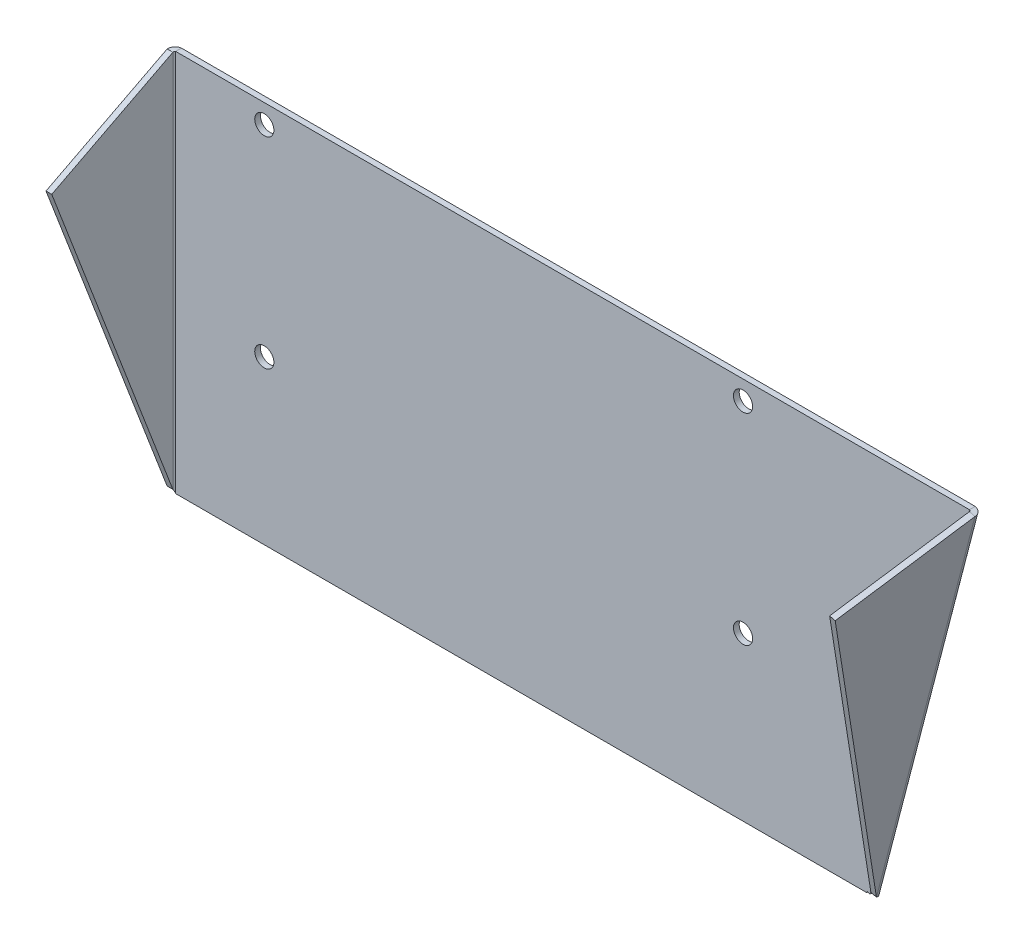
ISO-10303-21;
HEADER;
FILE_DESCRIPTION(('STEP AP214'),'2;1');
FILE_NAME('part.step','',(''),(''),'','','');
FILE_SCHEMA(('AUTOMOTIVE_DESIGN { 1 0 10303 214 1 1 1 1 }'));
ENDSEC;
DATA;
#1=APPLICATION_CONTEXT('core data for automotive mechanical design processes');
#2=APPLICATION_PROTOCOL_DEFINITION('international standard','automotive_design',2000,#1);
#3=PRODUCT_CONTEXT('',#1,'mechanical');
#4=PRODUCT('Part','Part','',(#3));
#5=PRODUCT_RELATED_PRODUCT_CATEGORY('part','',(#4));
#6=PRODUCT_DEFINITION_FORMATION('','',#4);
#7=PRODUCT_DEFINITION_CONTEXT('part definition',#1,'design');
#8=PRODUCT_DEFINITION('design','',#6,#7);
#9=PRODUCT_DEFINITION_SHAPE('','',#8);
#10=(LENGTH_UNIT() NAMED_UNIT(*) SI_UNIT(.MILLI.,.METRE.));
#11=(NAMED_UNIT(*) PLANE_ANGLE_UNIT() SI_UNIT($,.RADIAN.));
#12=(NAMED_UNIT(*) SI_UNIT($,.STERADIAN.) SOLID_ANGLE_UNIT());
#13=UNCERTAINTY_MEASURE_WITH_UNIT(LENGTH_MEASURE(1.E-05),#10,'distance_accuracy_value','');
#14=(GEOMETRIC_REPRESENTATION_CONTEXT(3) GLOBAL_UNCERTAINTY_ASSIGNED_CONTEXT((#13)) GLOBAL_UNIT_ASSIGNED_CONTEXT((#10,
#11,#12)) REPRESENTATION_CONTEXT('',''));
#15=CARTESIAN_POINT('',(0.,0.,0.));
#16=DIRECTION('',(0.,0.,1.));
#17=DIRECTION('',(1.,0.,0.));
#18=AXIS2_PLACEMENT_3D('',#15,#16,#17);
#19=CARTESIAN_POINT('',(364.,-200.,3.));
#20=DIRECTION('',(0.,1.,0.));
#21=DIRECTION('',(-1.,0.,0.));
#22=AXIS2_PLACEMENT_3D('',#19,#20,#21);
#23=PLANE('',#22);
#24=DIRECTION('',(0.,0.,-1.));
#25=VECTOR('',#24,1.);
#26=CARTESIAN_POINT('',(361.689039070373,-200.,3.));
#27=LINE('',#26,#25);
#28=CARTESIAN_POINT('',(361.689039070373,-200.,2.99999999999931));
#29=VERTEX_POINT('',#28);
#30=CARTESIAN_POINT('',(361.689039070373,-200.,0.));
#31=VERTEX_POINT('',#30);
#32=EDGE_CURVE('E55',#29,#31,#27,.T.);
#33=ORIENTED_EDGE('',*,*,#32,.F.);
#34=DIRECTION('',(1.,0.,0.));
#35=VECTOR('',#34,1.);
#36=CARTESIAN_POINT('',(364.,-200.,3.));
#37=LINE('',#36,#35);
#38=CARTESIAN_POINT('',(0.736599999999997,-200.,2.99999999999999));
#39=VERTEX_POINT('',#38);
#40=EDGE_CURVE('E292',#39,#29,#37,.T.);
#41=ORIENTED_EDGE('',*,*,#40,.F.);
#42=DIRECTION('',(0.,0.,-1.));
#43=VECTOR('',#42,1.);
#44=CARTESIAN_POINT('',(0.736599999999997,-200.,2.99999999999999));
#45=LINE('',#44,#43);
#46=CARTESIAN_POINT('',(0.736600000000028,-200.,0.));
#47=VERTEX_POINT('',#46);
#48=EDGE_CURVE('E343',#39,#47,#45,.T.);
#49=ORIENTED_EDGE('',*,*,#48,.T.);
#50=DIRECTION('',(1.,0.,0.));
#51=VECTOR('',#50,1.);
#52=CARTESIAN_POINT('',(364.,-200.,0.));
#53=LINE('',#52,#51);
#54=EDGE_CURVE('E326',#47,#31,#53,.T.);
#55=ORIENTED_EDGE('',*,*,#54,.T.);
#56=EDGE_LOOP('',(#33,#41,#49,#55));
#57=FACE_BOUND('',#56,.T.);
#58=ADVANCED_FACE('F41',(#57),#23,.F.);
#59=CARTESIAN_POINT('',(0.,0.,3.));
#60=DIRECTION('',(0.,-1.,0.));
#61=DIRECTION('',(0.,0.,-1.));
#62=AXIS2_PLACEMENT_3D('',#59,#60,#61);
#63=PLANE('',#62);
#64=DIRECTION('',(-8.26955704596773E-13,2.15008483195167E-13,-1.));
#65=VECTOR('',#64,1.);
#66=CARTESIAN_POINT('',(415.238910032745,0.,2.99999999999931));
#67=LINE('',#66,#65);
#68=CARTESIAN_POINT('',(415.238910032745,0.,2.99999999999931));
#69=VERTEX_POINT('',#68);
#70=CARTESIAN_POINT('',(415.238910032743,6.49464054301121E-13,-6.94973592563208E-13));
#71=VERTEX_POINT('',#70);
#72=EDGE_CURVE('E321',#69,#71,#67,.T.);
#73=ORIENTED_EDGE('',*,*,#72,.T.);
#74=DIRECTION('',(-1.,0.,0.));
#75=VECTOR('',#74,1.);
#76=CARTESIAN_POINT('',(0.,0.,0.));
#77=LINE('',#76,#75);
#78=CARTESIAN_POINT('',(0.736600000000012,0.,0.));
#79=VERTEX_POINT('',#78);
#80=EDGE_CURVE('E63',#71,#79,#77,.T.);
#81=ORIENTED_EDGE('',*,*,#80,.T.);
#82=DIRECTION('',(0.,0.,-1.));
#83=VECTOR('',#82,1.);
#84=CARTESIAN_POINT('',(0.736600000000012,0.,2.99999999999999));
#85=LINE('',#84,#83);
#86=CARTESIAN_POINT('',(0.736600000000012,0.,2.99999999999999));
#87=VERTEX_POINT('',#86);
#88=EDGE_CURVE('E330',#87,#79,#85,.T.);
#89=ORIENTED_EDGE('',*,*,#88,.F.);
#90=DIRECTION('',(-1.,0.,0.));
#91=VECTOR('',#90,1.);
#92=CARTESIAN_POINT('',(0.,0.,3.));
#93=LINE('',#92,#91);
#94=EDGE_CURVE('E322',#69,#87,#93,.T.);
#95=ORIENTED_EDGE('',*,*,#94,.F.);
#96=EDGE_LOOP('',(#73,#81,#89,#95));
#97=FACE_BOUND('',#96,.T.);
#98=ADVANCED_FACE('F310',(#97),#63,.F.);
#99=CARTESIAN_POINT('',(0.,0.,3.));
#100=DIRECTION('',(0.,0.,-1.));
#101=DIRECTION('',(-1.,0.,0.));
#102=AXIS2_PLACEMENT_3D('',#99,#100,#101);
#103=PLANE('',#102);
#104=CARTESIAN_POINT('',(297.,-115.000000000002,3.));
#105=DIRECTION('',(0.,0.,-1.));
#106=DIRECTION('',(-1.,0.,0.));
#107=AXIS2_PLACEMENT_3D('',#104,#105,#106);
#108=CIRCLE('',#107,4.99999999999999);
#109=CARTESIAN_POINT('',(292.,-115.000000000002,3.));
#110=VERTEX_POINT('',#109);
#111=EDGE_CURVE('E394',#110,#110,#108,.T.);
#112=ORIENTED_EDGE('',*,*,#111,.T.);
#113=EDGE_LOOP('',(#112));
#114=FACE_BOUND('',#113,.T.);
#115=CARTESIAN_POINT('',(297.,-10.0000000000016,3.));
#116=DIRECTION('',(0.,0.,-1.));
#117=DIRECTION('',(-1.,0.,0.));
#118=AXIS2_PLACEMENT_3D('',#115,#116,#117);
#119=CIRCLE('',#118,4.99999999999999);
#120=CARTESIAN_POINT('',(292.,-10.0000000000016,3.));
#121=VERTEX_POINT('',#120);
#122=EDGE_CURVE('E388',#121,#121,#119,.T.);
#123=ORIENTED_EDGE('',*,*,#122,.T.);
#124=EDGE_LOOP('',(#123));
#125=FACE_BOUND('',#124,.T.);
#126=CARTESIAN_POINT('',(47.,-115.000000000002,3.));
#127=DIRECTION('',(0.,0.,-1.));
#128=DIRECTION('',(-1.,0.,0.));
#129=AXIS2_PLACEMENT_3D('',#126,#127,#128);
#130=CIRCLE('',#129,5.);
#131=CARTESIAN_POINT('',(42.,-115.000000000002,3.));
#132=VERTEX_POINT('',#131);
#133=EDGE_CURVE('E382',#132,#132,#130,.T.);
#134=ORIENTED_EDGE('',*,*,#133,.T.);
#135=EDGE_LOOP('',(#134));
#136=FACE_BOUND('',#135,.T.);
#137=CARTESIAN_POINT('',(47.,-10.0000000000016,3.));
#138=DIRECTION('',(0.,0.,-1.));
#139=DIRECTION('',(-1.,0.,0.));
#140=AXIS2_PLACEMENT_3D('',#137,#138,#139);
#141=CIRCLE('',#140,5.);
#142=CARTESIAN_POINT('',(42.,-10.0000000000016,3.));
#143=VERTEX_POINT('',#142);
#144=EDGE_CURVE('E374',#143,#143,#141,.T.);
#145=ORIENTED_EDGE('',*,*,#144,.T.);
#146=EDGE_LOOP('',(#145));
#147=FACE_BOUND('',#146,.T.);
#148=DIRECTION('',(0.251633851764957,0.96782250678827,0.));
#149=VECTOR('',#148,1.);
#150=CARTESIAN_POINT('',(415.247383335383,0.0325896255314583,2.99999999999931));
#151=LINE('',#150,#149);
#152=CARTESIAN_POINT('',(363.287101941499,-199.81464650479,2.99999999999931));
#153=VERTEX_POINT('',#152);
#154=EDGE_CURVE('E172',#69,#153,#151,.F.);
#155=ORIENTED_EDGE('',*,*,#154,.F.);
#156=ORIENTED_EDGE('',*,*,#94,.T.);
#157=DIRECTION('',(0.,-1.,0.));
#158=VECTOR('',#157,1.);
#159=CARTESIAN_POINT('',(0.736599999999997,-200.,2.99999999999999));
#160=LINE('',#159,#158);
#161=EDGE_CURVE('E247',#39,#87,#160,.F.);
#162=ORIENTED_EDGE('',*,*,#161,.F.);
#163=ORIENTED_EDGE('',*,*,#40,.T.);
#164=DIRECTION('',(-0.251633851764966,-0.967822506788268,0.));
#165=VECTOR('',#164,1.);
#166=CARTESIAN_POINT('',(361.835368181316,-199.437195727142,2.99999999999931));
#167=LINE('',#166,#165);
#168=CARTESIAN_POINT('',(361.835368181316,-199.437195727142,2.99999999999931));
#169=VERTEX_POINT('',#168);
#170=EDGE_CURVE('E216',#169,#29,#167,.T.);
#171=ORIENTED_EDGE('',*,*,#170,.F.);
#172=DIRECTION('',(-0.967822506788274,0.251633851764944,0.));
#173=VECTOR('',#172,1.);
#174=CARTESIAN_POINT('',(363.287101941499,-199.81464650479,2.99999999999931));
#175=LINE('',#174,#173);
#176=EDGE_CURVE('E213',#153,#169,#175,.T.);
#177=ORIENTED_EDGE('',*,*,#176,.F.);
#178=EDGE_LOOP('',(#155,#156,#162,#163,#171,#177));
#179=FACE_BOUND('',#178,.T.);
#180=ADVANCED_FACE('F300',(#114,#125,#136,#147,#179),#103,.F.);
#181=CARTESIAN_POINT('',(0.,0.,0.));
#182=DIRECTION('',(0.,0.,-1.));
#183=DIRECTION('',(-1.,0.,0.));
#184=AXIS2_PLACEMENT_3D('',#181,#182,#183);
#185=PLANE('',#184);
#186=CARTESIAN_POINT('',(297.,-115.000000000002,0.));
#187=DIRECTION('',(0.,0.,-1.));
#188=DIRECTION('',(-1.,0.,0.));
#189=AXIS2_PLACEMENT_3D('',#186,#187,#188);
#190=CIRCLE('',#189,4.99999999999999);
#191=CARTESIAN_POINT('',(292.,-115.000000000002,0.));
#192=VERTEX_POINT('',#191);
#193=EDGE_CURVE('E397',#192,#192,#190,.T.);
#194=ORIENTED_EDGE('',*,*,#193,.F.);
#195=EDGE_LOOP('',(#194));
#196=FACE_BOUND('',#195,.T.);
#197=CARTESIAN_POINT('',(297.,-10.0000000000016,0.));
#198=DIRECTION('',(0.,0.,-1.));
#199=DIRECTION('',(-1.,0.,0.));
#200=AXIS2_PLACEMENT_3D('',#197,#198,#199);
#201=CIRCLE('',#200,4.99999999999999);
#202=CARTESIAN_POINT('',(292.,-10.0000000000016,0.));
#203=VERTEX_POINT('',#202);
#204=EDGE_CURVE('E391',#203,#203,#201,.T.);
#205=ORIENTED_EDGE('',*,*,#204,.F.);
#206=EDGE_LOOP('',(#205));
#207=FACE_BOUND('',#206,.T.);
#208=CARTESIAN_POINT('',(47.,-115.000000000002,0.));
#209=DIRECTION('',(0.,0.,-1.));
#210=DIRECTION('',(-1.,0.,0.));
#211=AXIS2_PLACEMENT_3D('',#208,#209,#210);
#212=CIRCLE('',#211,5.);
#213=CARTESIAN_POINT('',(42.,-115.000000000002,0.));
#214=VERTEX_POINT('',#213);
#215=EDGE_CURVE('E385',#214,#214,#212,.T.);
#216=ORIENTED_EDGE('',*,*,#215,.F.);
#217=EDGE_LOOP('',(#216));
#218=FACE_BOUND('',#217,.T.);
#219=CARTESIAN_POINT('',(47.,-10.0000000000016,0.));
#220=DIRECTION('',(0.,0.,-1.));
#221=DIRECTION('',(-1.,0.,0.));
#222=AXIS2_PLACEMENT_3D('',#219,#220,#221);
#223=CIRCLE('',#222,5.);
#224=CARTESIAN_POINT('',(42.,-10.0000000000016,0.));
#225=VERTEX_POINT('',#224);
#226=EDGE_CURVE('E377',#225,#225,#223,.T.);
#227=ORIENTED_EDGE('',*,*,#226,.F.);
#228=EDGE_LOOP('',(#227));
#229=FACE_BOUND('',#228,.T.);
#230=ORIENTED_EDGE('',*,*,#80,.F.);
#231=DIRECTION('',(0.251633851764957,0.96782250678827,0.));
#232=VECTOR('',#231,1.);
#233=CARTESIAN_POINT('',(415.247383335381,0.0325896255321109,-6.94756752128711E-13));
#234=LINE('',#233,#232);
#235=CARTESIAN_POINT('',(363.287101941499,-199.81464650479,0.));
#236=VERTEX_POINT('',#235);
#237=EDGE_CURVE('E137',#71,#236,#234,.F.);
#238=ORIENTED_EDGE('',*,*,#237,.T.);
#239=DIRECTION('',(-0.967822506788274,0.251633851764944,0.));
#240=VECTOR('',#239,1.);
#241=CARTESIAN_POINT('',(-25.6590483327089,-98.6886474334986,0.));
#242=LINE('',#241,#240);
#243=CARTESIAN_POINT('',(361.835368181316,-199.437195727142,0.));
#244=VERTEX_POINT('',#243);
#245=EDGE_CURVE('E11',#236,#244,#242,.T.);
#246=ORIENTED_EDGE('',*,*,#245,.T.);
#247=DIRECTION('',(-0.251633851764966,-0.967822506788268,0.));
#248=VECTOR('',#247,1.);
#249=CARTESIAN_POINT('',(387.494416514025,-100.748548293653,0.));
#250=LINE('',#249,#248);
#251=EDGE_CURVE('E48',#244,#31,#250,.T.);
#252=ORIENTED_EDGE('',*,*,#251,.T.);
#253=ORIENTED_EDGE('',*,*,#54,.F.);
#254=DIRECTION('',(0.,-1.,0.));
#255=VECTOR('',#254,1.);
#256=CARTESIAN_POINT('',(0.736600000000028,-200.,0.));
#257=LINE('',#256,#255);
#258=EDGE_CURVE('E256',#47,#79,#257,.F.);
#259=ORIENTED_EDGE('',*,*,#258,.T.);
#260=EDGE_LOOP('',(#230,#238,#246,#252,#253,#259));
#261=FACE_BOUND('',#260,.T.);
#262=ADVANCED_FACE('F309',(#196,#207,#218,#229,#261),#185,.T.);
#263=CARTESIAN_POINT('',(0.736599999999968,0.,-0.0300000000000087));
#264=CARTESIAN_POINT('',(0.243464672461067,-0.0316564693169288,-0.0300000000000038));
#265=CARTESIAN_POINT('',(-0.249299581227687,-0.0633015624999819,0.0680345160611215));
#266=CARTESIAN_POINT('',(-1.16033125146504,-0.126603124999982,0.445396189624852));
#267=CARTESIAN_POINT('',(-1.57815167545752,-0.158253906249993,0.724574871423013));
#268=CARTESIAN_POINT('',(-2.27542512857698,-0.221555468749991,1.42184832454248));
#269=CARTESIAN_POINT('',(-2.55460381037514,-0.253206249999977,1.83966874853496));
#270=CARTESIAN_POINT('',(-2.93196548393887,-0.316507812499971,2.75070041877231));
#271=CARTESIAN_POINT('',(-3.03,-0.348152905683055,3.24346467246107));
#272=CARTESIAN_POINT('',(-3.03,-0.379809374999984,3.73659999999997));
#273=CARTESIAN_POINT('',(0.736599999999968,0.,0.));
#274=CARTESIAN_POINT('',(0.247392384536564,-0.0316564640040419,0.));
#275=CARTESIAN_POINT('',(-0.241447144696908,-0.0633015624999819,0.0972536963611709));
#276=CARTESIAN_POINT('',(-1.14522268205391,-0.126603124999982,0.47160978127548));
#277=CARTESIAN_POINT('',(-1.55971527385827,-0.158253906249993,0.748564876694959));
#278=CARTESIAN_POINT('',(-2.25143512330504,-0.221555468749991,1.44028472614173));
#279=CARTESIAN_POINT('',(-2.52839021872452,-0.253206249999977,1.85477731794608));
#280=CARTESIAN_POINT('',(-2.90274630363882,-0.316507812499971,2.75855285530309));
#281=CARTESIAN_POINT('',(-3.,-0.348152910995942,3.24739238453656));
#282=CARTESIAN_POINT('',(-3.,-0.379809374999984,3.73659999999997));
#283=CARTESIAN_POINT('',(0.736599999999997,0.,2.99999999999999));
#284=CARTESIAN_POINT('',(0.640163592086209,-0.0316559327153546,2.99999999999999));
#285=CARTESIAN_POINT('',(0.543796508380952,-0.063301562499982,3.01917172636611));
#286=CARTESIAN_POINT('',(0.365634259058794,-0.126603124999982,3.09296894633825));
#287=CARTESIAN_POINT('',(0.283924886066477,-0.158253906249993,3.14756540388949));
#288=CARTESIAN_POINT('',(0.1475654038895,-0.221555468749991,3.28392488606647));
#289=CARTESIAN_POINT('',(0.0929689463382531,-0.253206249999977,3.36563425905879));
#290=CARTESIAN_POINT('',(0.0191717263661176,-0.316507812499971,3.54379650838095));
#291=CARTESIAN_POINT('',(0.,-0.348153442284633,3.64016359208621));
#292=CARTESIAN_POINT('',(0.,-0.379809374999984,3.73659999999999));
#293=CARTESIAN_POINT('',(0.736599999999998,0.,3.03029999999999));
#294=CARTESIAN_POINT('',(0.64413058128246,-0.0316559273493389,3.03029999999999));
#295=CARTESIAN_POINT('',(0.551727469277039,-0.063301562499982,3.04868309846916));
#296=CARTESIAN_POINT('',(0.380893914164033,-0.126603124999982,3.11944467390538));
#297=CARTESIAN_POINT('',(0.302545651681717,-0.158253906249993,3.17179530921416));
#298=CARTESIAN_POINT('',(0.171795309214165,-0.221555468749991,3.30254565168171));
#299=CARTESIAN_POINT('',(0.119444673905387,-0.253206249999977,3.38089391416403));
#300=CARTESIAN_POINT('',(0.0486830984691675,-0.316507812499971,3.55172746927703));
#301=CARTESIAN_POINT('',(0.0302999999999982,-0.348153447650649,3.64413058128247));
#302=CARTESIAN_POINT('',(0.0302999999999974,-0.379809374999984,3.73659999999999));
#303=B_SPLINE_SURFACE_WITH_KNOTS('',1,3,((#263,#264,#265,#266,#267,#268,#269,#270,#271,#272),
(#273,#274,#275,#276,#277,#278,#279,#280,#281,#282),(#283,#284,#285,#286,#287,#288,#289,#290,
#291,#292),(#293,#294,#295,#296,#297,#298,#299,#300,#301,#302)),.UNSPECIFIED.,.F.,.F.,.F.,(2,1,
1,2),(4,2,2,2,4),(-0.01,0.,1.,1.0101),(0.,0.25,0.5,0.75,1.),.UNSPECIFIED.);
#304=DIRECTION('',(-1.,0.,0.));
#305=VECTOR('',#304,1.);
#306=CARTESIAN_POINT('',(0.,-0.379809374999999,3.7366));
#307=LINE('',#306,#305);
#308=CARTESIAN_POINT('',(0.,-0.379809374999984,3.7366));
#309=VERTEX_POINT('',#308);
#310=CARTESIAN_POINT('',(-3.,-0.379809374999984,3.73659999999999));
#311=VERTEX_POINT('',#310);
#312=EDGE_CURVE('E223',#309,#311,#307,.T.);
#313=CARTESIAN_POINT('',(0.736599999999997,0.,2.99999999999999));
#314=CARTESIAN_POINT('',(0.724547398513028,-0.00395634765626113,2.9999997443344));
#315=CARTESIAN_POINT('',(0.712494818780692,-0.00791269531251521,3.0002958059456));
#316=CARTESIAN_POINT('',(0.688418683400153,-0.0158253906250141,3.00147872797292));
#317=CARTESIAN_POINT('',(0.67639512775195,-0.0197817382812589,3.00236558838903));
#318=CARTESIAN_POINT('',(0.652406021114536,-0.027694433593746,3.00472827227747));
#319=CARTESIAN_POINT('',(0.640440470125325,-0.0316507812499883,3.00620409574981));
#320=CARTESIAN_POINT('',(0.616596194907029,-0.0395634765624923,3.00974106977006));
#321=CARTESIAN_POINT('',(0.604717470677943,-0.0435198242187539,3.01180222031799));
#322=CARTESIAN_POINT('',(0.581075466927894,-0.0514325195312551,3.01650490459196));
#323=CARTESIAN_POINT('',(0.56931218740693,-0.0553888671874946,3.019146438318));
#324=CARTESIAN_POINT('',(0.545929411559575,-0.063301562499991,3.02500351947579));
#325=CARTESIAN_POINT('',(0.534309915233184,-0.067257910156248,3.02821906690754));
#326=CARTESIAN_POINT('',(0.511242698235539,-0.0751706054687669,3.03521643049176));
#327=CARTESIAN_POINT('',(0.499794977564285,-0.0791269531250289,3.03899824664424));
#328=CARTESIAN_POINT('',(0.477098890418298,-0.0870396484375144,3.04711903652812));
#329=CARTESIAN_POINT('',(0.465850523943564,-0.090995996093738,3.05145801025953));
#330=CARTESIAN_POINT('',(0.443580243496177,-0.0989086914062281,3.06068266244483));
#331=CARTESIAN_POINT('',(0.432558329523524,-0.102865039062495,3.06556834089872));
#332=CARTESIAN_POINT('',(0.410767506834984,-0.110777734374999,3.07587463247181));
#333=CARTESIAN_POINT('',(0.399998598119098,-0.114734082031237,3.08129524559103));
#334=CARTESIAN_POINT('',(0.378739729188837,-0.122646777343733,3.09265834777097));
#335=CARTESIAN_POINT('',(0.368249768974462,-0.126603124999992,3.0986008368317));
#336=CARTESIAN_POINT('',(0.347574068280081,-0.134515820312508,3.11099337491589));
#337=CARTESIAN_POINT('',(0.337388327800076,-0.138472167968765,3.11744342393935));
#338=CARTESIAN_POINT('',(0.317345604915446,-0.146384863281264,3.13083554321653));
#339=CARTESIAN_POINT('',(0.30748862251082,-0.150341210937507,3.13777761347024));
#340=CARTESIAN_POINT('',(0.288127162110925,-0.158253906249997,3.15213705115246));
#341=CARTESIAN_POINT('',(0.278622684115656,-0.162210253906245,3.15955441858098));
#342=CARTESIAN_POINT('',(0.259989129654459,-0.170122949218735,3.17484658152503));
#343=CARTESIAN_POINT('',(0.250860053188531,-0.174079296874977,3.18272137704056));
#344=CARTESIAN_POINT('',(0.232999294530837,-0.181991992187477,3.1989094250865));
#345=CARTESIAN_POINT('',(0.224267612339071,-0.185948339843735,3.2072226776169));
#346=CARTESIAN_POINT('',(0.207222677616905,-0.193861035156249,3.22426761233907));
#347=CARTESIAN_POINT('',(0.198909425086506,-0.197817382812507,3.23299929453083));
#348=CARTESIAN_POINT('',(0.182721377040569,-0.205730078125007,3.25086005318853));
#349=CARTESIAN_POINT('',(0.174846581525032,-0.20968642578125,3.25998912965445));
#350=CARTESIAN_POINT('',(0.159554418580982,-0.21759912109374,3.27862268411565));
#351=CARTESIAN_POINT('',(0.152137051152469,-0.221555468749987,3.28812716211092));
#352=CARTESIAN_POINT('',(0.137777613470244,-0.229468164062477,3.30748862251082));
#353=CARTESIAN_POINT('',(0.130835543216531,-0.23342451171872,3.31734560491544));
#354=CARTESIAN_POINT('',(0.117443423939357,-0.24133720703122,3.33738832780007));
#355=CARTESIAN_POINT('',(0.110993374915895,-0.245293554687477,3.34757406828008));
#356=CARTESIAN_POINT('',(0.0986008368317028,-0.253206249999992,3.36824976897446));
#357=CARTESIAN_POINT('',(0.0926583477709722,-0.257162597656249,3.37873972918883));
#358=CARTESIAN_POINT('',(0.081295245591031,-0.26507529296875,3.39999859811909));
#359=CARTESIAN_POINT('',(0.0758746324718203,-0.269031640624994,3.41076750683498));
#360=CARTESIAN_POINT('',(0.0655683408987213,-0.27694433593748,3.43255832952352));
#361=CARTESIAN_POINT('',(0.0606826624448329,-0.280900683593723,3.44358024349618));
#362=CARTESIAN_POINT('',(0.0514580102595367,-0.288813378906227,3.46585052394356));
#363=CARTESIAN_POINT('',(0.0471190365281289,-0.292769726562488,3.47709889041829));
#364=CARTESIAN_POINT('',(0.0389982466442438,-0.30068242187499,3.49979497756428));
#365=CARTESIAN_POINT('',(0.0352164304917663,-0.304638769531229,3.51124269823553));
#366=CARTESIAN_POINT('',(0.0282190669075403,-0.312551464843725,3.53430991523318));
#367=CARTESIAN_POINT('',(0.0250035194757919,-0.316507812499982,3.54592941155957));
#368=CARTESIAN_POINT('',(0.0191464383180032,-0.324420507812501,3.56931218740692));
#369=CARTESIAN_POINT('',(0.0165049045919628,-0.328376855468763,3.58107546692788));
#370=CARTESIAN_POINT('',(0.0118022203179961,-0.336289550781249,3.60471747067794));
#371=CARTESIAN_POINT('',(0.00974106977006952,-0.340245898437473,3.61659619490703));
#372=CARTESIAN_POINT('',(0.00620409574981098,-0.348158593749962,3.64044047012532));
#373=CARTESIAN_POINT('',(0.00472827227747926,-0.352114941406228,3.65240602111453));
#374=CARTESIAN_POINT('',(0.00236558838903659,-0.360027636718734,3.67639512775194));
#375=CARTESIAN_POINT('',(0.0014787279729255,-0.363983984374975,3.68841868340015));
#376=CARTESIAN_POINT('',(0.000295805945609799,-0.371896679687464,3.71249481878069));
#377=CARTESIAN_POINT('',(-2.55665594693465E-07,-0.375853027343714,3.72454739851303));
#378=CARTESIAN_POINT('',(0.,-0.379809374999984,3.73659999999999));
#379=B_SPLINE_CURVE_WITH_KNOTS('',3,(#313,#314,#315,#316,#317,#318,#319,#320,#321,#322,#323,
#324,#325,#326,#327,#328,#329,#330,#331,#332,#333,#334,#335,#336,#337,#338,#339,#340,#341,#342,
#343,#344,#345,#346,#347,#348,#349,#350,#351,#352,#353,#354,#355,#356,#357,#358,#359,#360,#361,
#362,#363,#364,#365,#366,#367,#368,#369,#370,#371,#372,#373,#374,#375,#376,#377,#378),
.UNSPECIFIED.,.F.,.F.,(4,2,2,2,2,2,2,2,2,2,2,2,2,2,2,2,2,2,2,2,2,2,2,2,2,2,2,2,2,2,2,2,4),(0.,
0.0380525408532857,0.0761050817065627,0.11415762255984,0.152210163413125,0.190262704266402,
0.228315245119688,0.266367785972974,0.304420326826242,0.342472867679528,0.380525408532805,
0.41857794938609,0.456630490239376,0.494683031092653,0.53273557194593,0.570788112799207,
0.608840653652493,0.646893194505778,0.684945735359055,0.722998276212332,0.76105081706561,
0.799103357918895,0.837155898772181,0.875208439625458,0.913260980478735,0.951313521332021,
0.989366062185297,1.02741860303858,1.06547114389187,1.10352368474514,1.14157622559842,
1.1796287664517,1.21768130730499),.UNSPECIFIED.);
#380=EDGE_CURVE('E250',#87,#309,#379,.T.);
#381=CARTESIAN_POINT('',(0.736599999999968,0.,0.));
#382=CARTESIAN_POINT('',(0.675459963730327,-0.00395634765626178,-1.29693192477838E-06));
#383=CARTESIAN_POINT('',(0.614320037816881,-0.00791269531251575,0.00150055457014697));
#384=CARTESIAN_POINT('',(0.492187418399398,-0.0158253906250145,0.00750124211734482));
#385=CARTESIAN_POINT('',(0.431194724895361,-0.0197817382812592,0.0120000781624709));
#386=CARTESIAN_POINT('',(0.30950358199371,-0.0276944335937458,0.0239854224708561));
#387=CARTESIAN_POINT('',(0.248805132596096,-0.0316507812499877,0.0314719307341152));
#388=CARTESIAN_POINT('',(0.12784868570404,-0.039563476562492,0.0494141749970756));
#389=CARTESIAN_POINT('',(0.0675906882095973,-0.0435198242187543,0.0598699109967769));
#390=CARTESIAN_POINT('',(-0.0523396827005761,-0.0514325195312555,0.0837255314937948));
#391=CARTESIAN_POINT('',(-0.112012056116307,-0.0553888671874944,0.0971254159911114));
#392=CARTESIAN_POINT('',(-0.23062742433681,-0.0633015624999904,0.126837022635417));
#393=CARTESIAN_POINT('',(-0.289570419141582,-0.0672579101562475,0.143148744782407));
#394=CARTESIAN_POINT('',(-0.406585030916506,-0.0751706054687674,0.178644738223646));
#395=CARTESIAN_POINT('',(-0.464656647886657,-0.0791269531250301,0.197829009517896));
#396=CARTESIAN_POINT('',(-0.579788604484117,-0.087039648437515,0.239023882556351));
#397=CARTESIAN_POINT('',(-0.636848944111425,-0.0909959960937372,0.261034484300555));
#398=CARTESIAN_POINT('',(-0.749820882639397,-0.0989086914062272,0.307828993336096));
#399=CARTESIAN_POINT('',(-0.805732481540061,-0.102865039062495,0.332612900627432));
#400=CARTESIAN_POINT('',(-0.916272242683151,-0.110777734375,0.384894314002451));
#401=CARTESIAN_POINT('',(-0.970900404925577,-0.114734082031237,0.412391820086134));
#402=CARTESIAN_POINT('',(-1.07874168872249,-0.122646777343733,0.470034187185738));
#403=CARTESIAN_POINT('',(-1.13195481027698,-0.126603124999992,0.500179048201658));
#404=CARTESIAN_POINT('',(-1.23683781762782,-0.134515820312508,0.563043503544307));
#405=CARTESIAN_POINT('',(-1.28850770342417,-0.138472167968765,0.595763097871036));
#406=CARTESIAN_POINT('',(-1.39017976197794,-0.146384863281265,0.663698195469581));
#407=CARTESIAN_POINT('',(-1.44018193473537,-0.150341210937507,0.698913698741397));
#408=CARTESIAN_POINT('',(-1.5383981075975,-0.158253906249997,0.771755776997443));
#409=CARTESIAN_POINT('',(-1.5866121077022,-0.162210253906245,0.809382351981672));
#410=CARTESIAN_POINT('',(-1.68113578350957,-0.170122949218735,0.886955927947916));
#411=CARTESIAN_POINT('',(-1.72744545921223,-0.174079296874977,0.926902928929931));
#412=CARTESIAN_POINT('',(-1.81804892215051,-0.181991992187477,1.00902112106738));
#413=CARTESIAN_POINT('',(-1.86234270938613,-0.185948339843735,1.05119231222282));
#414=CARTESIAN_POINT('',(-1.94880768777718,-0.19386103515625,1.13765729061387));
#415=CARTESIAN_POINT('',(-1.99097887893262,-0.197817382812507,1.18195107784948));
#416=CARTESIAN_POINT('',(-2.07309707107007,-0.205730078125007,1.27255454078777));
#417=CARTESIAN_POINT('',(-2.11304407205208,-0.20968642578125,1.31886421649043));
#418=CARTESIAN_POINT('',(-2.19061764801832,-0.21759912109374,1.4133878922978));
#419=CARTESIAN_POINT('',(-2.22824422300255,-0.221555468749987,1.4616018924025));
#420=CARTESIAN_POINT('',(-2.3010863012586,-0.229468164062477,1.55981806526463));
#421=CARTESIAN_POINT('',(-2.33630180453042,-0.233424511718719,1.60982023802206));
#422=CARTESIAN_POINT('',(-2.40423690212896,-0.241337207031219,1.71149229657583));
#423=CARTESIAN_POINT('',(-2.43695649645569,-0.245293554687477,1.76316218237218));
#424=CARTESIAN_POINT('',(-2.49982095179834,-0.253206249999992,1.86804518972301));
#425=CARTESIAN_POINT('',(-2.52996581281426,-0.257162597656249,1.9212583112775));
#426=CARTESIAN_POINT('',(-2.58760817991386,-0.26507529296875,2.02909959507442));
#427=CARTESIAN_POINT('',(-2.61510568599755,-0.269031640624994,2.08372775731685));
#428=CARTESIAN_POINT('',(-2.66738709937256,-0.27694433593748,2.19426751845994));
#429=CARTESIAN_POINT('',(-2.6921710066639,-0.280900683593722,2.2501791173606));
#430=CARTESIAN_POINT('',(-2.73896551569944,-0.288813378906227,2.36315105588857));
#431=CARTESIAN_POINT('',(-2.76097611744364,-0.292769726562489,2.42021139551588));
#432=CARTESIAN_POINT('',(-2.8021709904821,-0.30068242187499,2.53534335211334));
#433=CARTESIAN_POINT('',(-2.82135526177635,-0.304638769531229,2.59341496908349));
#434=CARTESIAN_POINT('',(-2.85685125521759,-0.312551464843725,2.71042958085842));
#435=CARTESIAN_POINT('',(-2.87316297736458,-0.316507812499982,2.76937257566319));
#436=CARTESIAN_POINT('',(-2.90287458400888,-0.324420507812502,2.88798794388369));
#437=CARTESIAN_POINT('',(-2.9162744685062,-0.328376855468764,2.94766031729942));
#438=CARTESIAN_POINT('',(-2.94013008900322,-0.33628955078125,3.0675906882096));
#439=CARTESIAN_POINT('',(-2.95058582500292,-0.340245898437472,3.12784868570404));
#440=CARTESIAN_POINT('',(-2.96852806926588,-0.348158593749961,3.2488051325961));
#441=CARTESIAN_POINT('',(-2.97601457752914,-0.352114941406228,3.30950358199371));
#442=CARTESIAN_POINT('',(-2.98799992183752,-0.360027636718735,3.43119472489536));
#443=CARTESIAN_POINT('',(-2.99249875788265,-0.363983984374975,3.4921874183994));
#444=CARTESIAN_POINT('',(-2.99849944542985,-0.371896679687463,3.61432003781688));
#445=CARTESIAN_POINT('',(-3.00000129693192,-0.375853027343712,3.67545996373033));
#446=CARTESIAN_POINT('',(-3.,-0.379809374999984,3.73659999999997));
#447=B_SPLINE_CURVE_WITH_KNOTS('',3,(#381,#382,#383,#384,#385,#386,#387,#388,#389,#390,#391,
#392,#393,#394,#395,#396,#397,#398,#399,#400,#401,#402,#403,#404,#405,#406,#407,#408,#409,#410,
#411,#412,#413,#414,#415,#416,#417,#418,#419,#420,#421,#422,#423,#424,#425,#426,#427,#428,#429,
#430,#431,#432,#433,#434,#435,#436,#437,#438,#439,#440,#441,#442,#443,#444,#445,#446),
.UNSPECIFIED.,.F.,.F.,(4,2,2,2,2,2,2,2,2,2,2,2,2,2,2,2,2,2,2,2,2,2,2,2,2,2,2,2,2,2,2,2,4),(0.,
0.183785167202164,0.367570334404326,0.551355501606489,0.735140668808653,0.918925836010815,
1.10271100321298,1.28649617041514,1.4702813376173,1.65406650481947,1.83785167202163,
2.0216368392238,2.20542200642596,2.38920717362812,2.57299234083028,2.75677750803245,
2.94056267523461,3.12434784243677,3.30813300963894,3.4919181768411,3.67570334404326,
3.85948851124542,4.04327367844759,4.22705884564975,4.41084401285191,4.59462918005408,
4.77841434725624,4.9621995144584,5.14598468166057,5.32976984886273,5.51355501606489,
5.69734018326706,5.88112535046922),.UNSPECIFIED.);
#448=EDGE_CURVE('E346',#79,#311,#447,.T.);
#449=ORIENTED_EDGE('',*,*,#312,.F.);
#450=ORIENTED_EDGE('',*,*,#380,.F.);
#451=ORIENTED_EDGE('',*,*,#88,.T.);
#452=ORIENTED_EDGE('',*,*,#448,.T.);
#453=EDGE_LOOP('',(#449,#450,#451,#452));
#454=FACE_BOUND('',#453,.T.);
#455=ADVANCED_FACE('F274',(#454),#303,.F.);
#456=CARTESIAN_POINT('',(-3.03000000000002,-198.077934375,3.73659999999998));
#457=CARTESIAN_POINT('',(-3.03000000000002,-198.238132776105,3.24347281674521));
#458=CARTESIAN_POINT('',(-2.93196548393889,-198.398278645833,2.75070041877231));
#459=CARTESIAN_POINT('',(-2.55460381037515,-198.718622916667,1.83966874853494));
#460=CARTESIAN_POINT('',(-2.27542512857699,-198.878795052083,1.42184832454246));
#461=CARTESIAN_POINT('',(-1.57815167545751,-199.199139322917,0.72457487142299));
#462=CARTESIAN_POINT('',(-1.16033125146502,-199.359311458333,0.445396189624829));
#463=CARTESIAN_POINT('',(-0.249299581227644,-199.679655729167,0.0680345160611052));
#464=CARTESIAN_POINT('',(0.243472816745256,-199.839801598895,-0.0300000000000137));
#465=CARTESIAN_POINT('',(0.736600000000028,-200.,-0.0300000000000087));
#466=CARTESIAN_POINT('',(-3.00000000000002,-198.077934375,3.73659999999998));
#467=CARTESIAN_POINT('',(-3.00000000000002,-198.238132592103,3.24740055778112));
#468=CARTESIAN_POINT('',(-2.90274630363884,-198.398278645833,2.75855285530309));
#469=CARTESIAN_POINT('',(-2.52839021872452,-198.718622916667,1.85477731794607));
#470=CARTESIAN_POINT('',(-2.25143512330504,-198.878795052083,1.44028472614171));
#471=CARTESIAN_POINT('',(-1.55971527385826,-199.199139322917,0.748564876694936));
#472=CARTESIAN_POINT('',(-1.14522268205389,-199.359311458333,0.471609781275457));
#473=CARTESIAN_POINT('',(-0.241447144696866,-199.679655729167,0.0972536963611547));
#474=CARTESIAN_POINT('',(0.247400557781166,-199.839801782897,0.));
#475=CARTESIAN_POINT('',(0.736600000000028,-200.,0.));
#476=CARTESIAN_POINT('',(0.,-198.077934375,3.7366));
#477=CARTESIAN_POINT('',(0.,-198.23811419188,3.64017466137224));
#478=CARTESIAN_POINT('',(0.0191717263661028,-198.398278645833,3.54379650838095));
#479=CARTESIAN_POINT('',(0.0929689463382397,-198.718622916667,3.36563425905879));
#480=CARTESIAN_POINT('',(0.147565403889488,-198.878795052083,3.28392488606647));
#481=CARTESIAN_POINT('',(0.283924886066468,-199.199139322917,3.14756540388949));
#482=CARTESIAN_POINT('',(0.365634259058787,-199.359311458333,3.09296894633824));
#483=CARTESIAN_POINT('',(0.543796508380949,-199.679655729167,3.01917172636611));
#484=CARTESIAN_POINT('',(0.640174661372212,-199.83982018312,2.99999999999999));
#485=CARTESIAN_POINT('',(0.736599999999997,-200.,2.99999999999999));
#486=CARTESIAN_POINT('',(0.0302999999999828,-198.077934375,3.7366));
#487=CARTESIAN_POINT('',(0.0302999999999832,-198.238114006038,3.64414167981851));
#488=CARTESIAN_POINT('',(0.0486830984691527,-198.398278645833,3.55172746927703));
#489=CARTESIAN_POINT('',(0.119444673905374,-198.718622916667,3.38089391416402));
#490=CARTESIAN_POINT('',(0.171795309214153,-198.878795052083,3.30254565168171));
#491=CARTESIAN_POINT('',(0.302545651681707,-199.199139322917,3.17179530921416));
#492=CARTESIAN_POINT('',(0.380893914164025,-199.359311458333,3.11944467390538));
#493=CARTESIAN_POINT('',(0.551727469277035,-199.679655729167,3.04868309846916));
#494=CARTESIAN_POINT('',(0.644141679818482,-199.839820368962,3.03029999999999));
#495=CARTESIAN_POINT('',(0.736599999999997,-200.,3.03029999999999));
#496=B_SPLINE_SURFACE_WITH_KNOTS('',1,3,((#456,#457,#458,#459,#460,#461,#462,#463,#464,#465),
(#466,#467,#468,#469,#470,#471,#472,#473,#474,#475),(#476,#477,#478,#479,#480,#481,#482,#483,
#484,#485),(#486,#487,#488,#489,#490,#491,#492,#493,#494,#495)),.UNSPECIFIED.,.F.,.F.,.F.,(2,1,
1,2),(4,2,2,2,4),(-0.01,0.,1.,1.0101),(0.,0.25,0.5,0.75,1.),.UNSPECIFIED.);
#497=CARTESIAN_POINT('',(0.,-198.077934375,3.7366));
#498=CARTESIAN_POINT('',(-3.26175909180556E-05,-198.145081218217,3.69617655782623));
#499=CARTESIAN_POINT('',(0.00332556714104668,-198.212226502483,3.65575978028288));
#500=CARTESIAN_POINT('',(0.0165904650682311,-198.346506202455,3.57601951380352));
#501=CARTESIAN_POINT('',(0.0264961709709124,-198.413640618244,3.5366958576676));
#502=CARTESIAN_POINT('',(0.0525964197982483,-198.547774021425,3.46028700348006));
#503=CARTESIAN_POINT('',(0.0687780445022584,-198.614773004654,3.42319738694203));
#504=CARTESIAN_POINT('',(0.106987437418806,-198.748762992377,3.35216172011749));
#505=CARTESIAN_POINT('',(0.129014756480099,-198.815753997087,3.31821542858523));
#506=CARTESIAN_POINT('',(0.178459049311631,-198.950112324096,3.25420672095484));
#507=CARTESIAN_POINT('',(0.205905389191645,-199.017479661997,3.22416701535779));
#508=CARTESIAN_POINT('',(0.265365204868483,-199.152212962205,3.16900719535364));
#509=CARTESIAN_POINT('',(0.297378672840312,-199.219578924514,3.14388707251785));
#510=CARTESIAN_POINT('',(0.365036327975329,-199.354185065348,3.09929425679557));
#511=CARTESIAN_POINT('',(0.400673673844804,-199.421425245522,3.07981118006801));
#512=CARTESIAN_POINT('',(0.47464670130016,-199.555880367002,3.04696459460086));
#513=CARTESIAN_POINT('',(0.512981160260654,-199.623095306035,3.03359833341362));
#514=CARTESIAN_POINT('',(0.58223948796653,-199.741930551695,3.01568525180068));
#515=CARTESIAN_POINT('',(0.612821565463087,-199.793554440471,3.0098123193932));
#516=CARTESIAN_POINT('',(0.674468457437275,-199.896783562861,3.00196518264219));
#517=CARTESIAN_POINT('',(0.705533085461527,-199.948388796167,2.99998950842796));
#518=CARTESIAN_POINT('',(0.736599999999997,-200.,2.99999999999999));
#519=B_SPLINE_CURVE_WITH_KNOTS('',3,(#497,#498,#499,#500,#501,#502,#503,#504,#505,#506,#507,
#508,#509,#510,#511,#512,#513,#514,#515,#516,#517,#518),.UNSPECIFIED.,.F.,.F.,(4,2,2,2,2,2,2,2,
2,2,4),(0.,0.235048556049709,0.470060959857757,0.704592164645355,0.939105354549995,
1.17492611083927,1.41074646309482,1.64612961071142,1.88140673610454,2.06215098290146,
2.24282704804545),.UNSPECIFIED.);
#520=CARTESIAN_POINT('',(0.,-198.077934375,3.7366));
#521=VERTEX_POINT('',#520);
#522=EDGE_CURVE('E246',#521,#39,#519,.T.);
#523=DIRECTION('',(-1.,0.,0.));
#524=VECTOR('',#523,1.);
#525=CARTESIAN_POINT('',(0.,-198.077934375,3.7366));
#526=LINE('',#525,#524);
#527=CARTESIAN_POINT('',(-3.,-198.077934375,3.73659999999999));
#528=VERTEX_POINT('',#527);
#529=EDGE_CURVE('E226',#521,#528,#526,.T.);
#530=CARTESIAN_POINT('',(-3.00000000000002,-198.077934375,3.73659999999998));
#531=CARTESIAN_POINT('',(-3.00002123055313,-198.118139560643,3.61383160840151));
#532=CARTESIAN_POINT('',(-2.9939505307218,-198.158343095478,3.49106562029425));
#533=CARTESIAN_POINT('',(-2.96977655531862,-198.238748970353,3.24672037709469));
#534=CARTESIAN_POINT('',(-2.95167303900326,-198.278951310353,3.1251411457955));
#535=CARTESIAN_POINT('',(-2.90363046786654,-198.359278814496,2.88458538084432));
#536=CARTESIAN_POINT('',(-2.87371399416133,-198.399403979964,2.76560433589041));
#537=CARTESIAN_POINT('',(-2.80234352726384,-198.479653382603,2.53116851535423));
#538=CARTESIAN_POINT('',(-2.76089104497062,-198.519777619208,2.41571328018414));
#539=CARTESIAN_POINT('',(-2.67142861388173,-198.596118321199,2.20045019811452));
#540=CARTESIAN_POINT('',(-2.62444878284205,-198.632335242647,2.10021273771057));
#541=CARTESIAN_POINT('',(-2.5217672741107,-198.70477994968,1.90426281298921));
#542=CARTESIAN_POINT('',(-2.4660627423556,-198.741007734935,1.80855184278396));
#543=CARTESIAN_POINT('',(-2.34643116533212,-198.813432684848,1.62252367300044));
#544=CARTESIAN_POINT('',(-2.2825107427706,-198.849629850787,1.53220221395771));
#545=CARTESIAN_POINT('',(-2.14689304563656,-198.922040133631,1.35755074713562));
#546=CARTESIAN_POINT('',(-2.07519309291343,-198.958253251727,1.2732228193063));
#547=CARTESIAN_POINT('',(-1.92462039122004,-199.030668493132,1.11127973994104));
#548=CARTESIAN_POINT('',(-1.84574972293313,-199.066870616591,1.03366265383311));
#549=CARTESIAN_POINT('',(-1.68143893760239,-199.139274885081,0.885725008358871));
#550=CARTESIAN_POINT('',(-1.59599882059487,-199.175477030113,0.815404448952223));
#551=CARTESIAN_POINT('',(-1.41915793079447,-199.247903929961,0.682565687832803));
#552=CARTESIAN_POINT('',(-1.32775296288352,-199.28412868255,0.620053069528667));
#553=CARTESIAN_POINT('',(-1.13979163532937,-199.356567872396,0.50340282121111));
#554=CARTESIAN_POINT('',(-1.04323707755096,-199.392782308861,0.449262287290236));
#555=CARTESIAN_POINT('',(-0.845619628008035,-199.465244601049,0.349711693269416));
#556=CARTESIAN_POINT('',(-0.744552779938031,-199.501492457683,0.304309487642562));
#557=CARTESIAN_POINT('',(-0.538826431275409,-199.573975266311,0.22266928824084));
#558=CARTESIAN_POINT('',(-0.434168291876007,-199.610210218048,0.18642786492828));
#559=CARTESIAN_POINT('',(-0.222175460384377,-199.682633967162,0.12340968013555));
#560=CARTESIAN_POINT('',(-0.114844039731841,-199.718822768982,0.0966219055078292));
#561=CARTESIAN_POINT('',(0.101727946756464,-199.791185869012,0.0526732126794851));
#562=CARTESIAN_POINT('',(0.210967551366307,-199.82736016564,0.0355075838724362));
#563=CARTESIAN_POINT('',(0.389816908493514,-199.886294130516,0.0154769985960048));
#564=CARTESIAN_POINT('',(0.459109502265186,-199.909056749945,0.00966979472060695));
#565=CARTESIAN_POINT('',(0.597798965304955,-199.954545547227,0.0019338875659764));
#566=CARTESIAN_POINT('',(0.667195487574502,-199.977271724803,-1.03916945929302E-06));
#567=CARTESIAN_POINT('',(0.736600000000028,-200.,0.));
#568=B_SPLINE_CURVE_WITH_KNOTS('',3,(#530,#531,#532,#533,#534,#535,#536,#537,#538,#539,#540,
#541,#542,#543,#544,#545,#546,#547,#548,#549,#550,#551,#552,#553,#554,#555,#556,#557,#558,#559,
#560,#561,#562,#563,#564,#565,#566,#567),.UNSPECIFIED.,.F.,.F.,(4,2,2,2,2,2,2,2,2,2,2,2,2,2,2,2,
2,2,4),(0.,0.387406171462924,0.774820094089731,1.16149701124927,1.54812330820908,
1.89714055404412,2.24627221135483,2.59512418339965,2.94409663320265,3.29296814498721,
3.64183965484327,3.99095922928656,4.33995743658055,4.68926789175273,5.03844738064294,
5.38721873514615,5.73581919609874,5.95522378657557,6.17427546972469),.UNSPECIFIED.);
#569=EDGE_CURVE('E255',#528,#47,#568,.T.);
#570=ORIENTED_EDGE('',*,*,#522,.F.);
#571=ORIENTED_EDGE('',*,*,#529,.T.);
#572=ORIENTED_EDGE('',*,*,#569,.T.);
#573=ORIENTED_EDGE('',*,*,#48,.F.);
#574=EDGE_LOOP('',(#570,#571,#572,#573));
#575=FACE_BOUND('',#574,.T.);
#576=ADVANCED_FACE('F271',(#575),#496,.F.);
#577=CARTESIAN_POINT('',(0.73659999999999,-200.,3.7366));
#578=DIRECTION('',(0.,-1.,0.));
#579=DIRECTION('',(-1.,0.,0.));
#580=AXIS2_PLACEMENT_3D('',#577,#578,#579);
#581=CYLINDRICAL_SURFACE('',#580,3.73660000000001);
#582=ORIENTED_EDGE('',*,*,#258,.F.);
#583=ORIENTED_EDGE('',*,*,#569,.F.);
#584=DIRECTION('',(0.,1.,0.));
#585=VECTOR('',#584,1.);
#586=CARTESIAN_POINT('',(-3.,-33.,3.73659999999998));
#587=LINE('',#586,#585);
#588=EDGE_CURVE('E229',#528,#311,#587,.T.);
#589=ORIENTED_EDGE('',*,*,#588,.T.);
#590=ORIENTED_EDGE('',*,*,#448,.F.);
#591=EDGE_LOOP('',(#582,#583,#589,#590));
#592=FACE_BOUND('',#591,.T.);
#593=ADVANCED_FACE('F269',(#592),#581,.T.);
#594=CARTESIAN_POINT('',(0.73659999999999,-200.,3.7366));
#595=DIRECTION('',(0.,-1.,0.));
#596=DIRECTION('',(-1.,0.,0.));
#597=AXIS2_PLACEMENT_3D('',#594,#595,#596);
#598=CYLINDRICAL_SURFACE('',#597,0.736600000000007);
#599=ORIENTED_EDGE('',*,*,#161,.T.);
#600=ORIENTED_EDGE('',*,*,#380,.T.);
#601=DIRECTION('',(0.,-1.,0.));
#602=VECTOR('',#601,1.);
#603=CARTESIAN_POINT('',(0.,-0.379809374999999,3.7366));
#604=LINE('',#603,#602);
#605=EDGE_CURVE('E224',#309,#521,#604,.T.);
#606=ORIENTED_EDGE('',*,*,#605,.T.);
#607=ORIENTED_EDGE('',*,*,#522,.T.);
#608=EDGE_LOOP('',(#599,#600,#606,#607));
#609=FACE_BOUND('',#608,.T.);
#610=ADVANCED_FACE('F258',(#609),#598,.F.);
#611=CARTESIAN_POINT('',(-3.,0.,2.99999999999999));
#612=DIRECTION('',(0.,-0.888803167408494,-0.458289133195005));
#613=DIRECTION('',(0.,0.458289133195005,-0.888803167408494));
#614=AXIS2_PLACEMENT_3D('',#611,#612,#613);
#615=PLANE('',#614);
#616=ORIENTED_EDGE('',*,*,#312,.T.);
#617=DIRECTION('',(0.,0.458289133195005,-0.888803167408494));
#618=VECTOR('',#617,1.);
#619=CARTESIAN_POINT('',(-3.,0.,2.99999999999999));
#620=LINE('',#619,#618);
#621=CARTESIAN_POINT('',(-3.00000000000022,-33.,67.));
#622=VERTEX_POINT('',#621);
#623=EDGE_CURVE('E234',#622,#311,#620,.T.);
#624=ORIENTED_EDGE('',*,*,#623,.F.);
#625=DIRECTION('',(1.,0.,0.));
#626=VECTOR('',#625,1.);
#627=CARTESIAN_POINT('',(-3.00000000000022,-33.,67.));
#628=LINE('',#627,#626);
#629=CARTESIAN_POINT('',(-2.23454935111E-13,-33.,67.));
#630=VERTEX_POINT('',#629);
#631=EDGE_CURVE('E240',#622,#630,#628,.T.);
#632=ORIENTED_EDGE('',*,*,#631,.T.);
#633=DIRECTION('',(0.,0.458289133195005,-0.888803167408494));
#634=VECTOR('',#633,1.);
#635=CARTESIAN_POINT('',(0.,0.,3.));
#636=LINE('',#635,#634);
#637=EDGE_CURVE('E233',#630,#309,#636,.T.);
#638=ORIENTED_EDGE('',*,*,#637,.T.);
#639=EDGE_LOOP('',(#616,#624,#632,#638));
#640=FACE_BOUND('',#639,.T.);
#641=ADVANCED_FACE('F268',(#640),#615,.F.);
#642=CARTESIAN_POINT('',(-3.00000000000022,-33.,67.));
#643=DIRECTION('',(0.,0.357854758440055,-0.933777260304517));
#644=DIRECTION('',(0.,0.933777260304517,0.357854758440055));
#645=AXIS2_PLACEMENT_3D('',#642,#643,#644);
#646=PLANE('',#645);
#647=ORIENTED_EDGE('',*,*,#529,.F.);
#648=DIRECTION('',(0.,0.933777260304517,0.357854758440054));
#649=VECTOR('',#648,1.);
#650=CARTESIAN_POINT('',(-2.23454935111E-13,-33.,67.));
#651=LINE('',#650,#649);
#652=EDGE_CURVE('E238',#521,#630,#651,.T.);
#653=ORIENTED_EDGE('',*,*,#652,.T.);
#654=ORIENTED_EDGE('',*,*,#631,.F.);
#655=DIRECTION('',(0.,0.933777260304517,0.357854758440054));
#656=VECTOR('',#655,1.);
#657=CARTESIAN_POINT('',(-3.00000000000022,-33.,67.));
#658=LINE('',#657,#656);
#659=EDGE_CURVE('E237',#528,#622,#658,.T.);
#660=ORIENTED_EDGE('',*,*,#659,.F.);
#661=EDGE_LOOP('',(#647,#653,#654,#660));
#662=FACE_BOUND('',#661,.T.);
#663=ADVANCED_FACE('F482',(#662),#646,.F.);
#664=CARTESIAN_POINT('',(-3.00000000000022,-33.,67.));
#665=DIRECTION('',(1.,0.,0.));
#666=DIRECTION('',(0.,0.,-1.));
#667=AXIS2_PLACEMENT_3D('',#664,#665,#666);
#668=PLANE('',#667);
#669=ORIENTED_EDGE('',*,*,#588,.F.);
#670=ORIENTED_EDGE('',*,*,#659,.T.);
#671=ORIENTED_EDGE('',*,*,#623,.T.);
#672=EDGE_LOOP('',(#669,#670,#671));
#673=FACE_BOUND('',#672,.T.);
#674=ADVANCED_FACE('F472',(#673),#668,.F.);
#675=CARTESIAN_POINT('',(-2.23454935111E-13,-33.,67.));
#676=DIRECTION('',(1.,0.,0.));
#677=DIRECTION('',(0.,0.,-1.));
#678=AXIS2_PLACEMENT_3D('',#675,#676,#677);
#679=PLANE('',#678);
#680=ORIENTED_EDGE('',*,*,#652,.F.);
#681=ORIENTED_EDGE('',*,*,#605,.F.);
#682=ORIENTED_EDGE('',*,*,#637,.F.);
#683=EDGE_LOOP('',(#680,#681,#682));
#684=FACE_BOUND('',#683,.T.);
#685=ADVANCED_FACE('F467',(#684),#679,.T.);
#686=CARTESIAN_POINT('',(361.835368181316,-199.437195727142,2.99999999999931));
#687=DIRECTION('',(0.967822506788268,-0.251633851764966,0.));
#688=DIRECTION('',(0.251633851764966,0.967822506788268,0.));
#689=AXIS2_PLACEMENT_3D('',#686,#687,#688);
#690=PLANE('',#689);
#691=ORIENTED_EDGE('',*,*,#170,.T.);
#692=ORIENTED_EDGE('',*,*,#32,.T.);
#693=ORIENTED_EDGE('',*,*,#251,.F.);
#694=DIRECTION('',(0.,0.,-1.));
#695=VECTOR('',#694,1.);
#696=CARTESIAN_POINT('',(361.835368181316,-199.437195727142,2.99999999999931));
#697=LINE('',#696,#695);
#698=EDGE_CURVE('E218',#169,#244,#697,.T.);
#699=ORIENTED_EDGE('',*,*,#698,.F.);
#700=EDGE_LOOP('',(#691,#692,#693,#699));
#701=FACE_BOUND('',#700,.T.);
#702=ADVANCED_FACE('F358',(#701),#690,.T.);
#703=CARTESIAN_POINT('',(363.287101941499,-199.81464650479,2.99999999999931));
#704=DIRECTION('',(-0.251633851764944,-0.967822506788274,0.));
#705=DIRECTION('',(0.967822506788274,-0.251633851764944,0.));
#706=AXIS2_PLACEMENT_3D('',#703,#704,#705);
#707=PLANE('',#706);
#708=ORIENTED_EDGE('',*,*,#245,.F.);
#709=DIRECTION('',(-8.26955704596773E-13,2.15008483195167E-13,-1.));
#710=VECTOR('',#709,1.);
#711=CARTESIAN_POINT('',(363.287101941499,-199.81464650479,2.99999999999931));
#712=LINE('',#711,#710);
#713=EDGE_CURVE('E221',#153,#236,#712,.T.);
#714=ORIENTED_EDGE('',*,*,#713,.F.);
#715=ORIENTED_EDGE('',*,*,#176,.T.);
#716=ORIENTED_EDGE('',*,*,#698,.T.);
#717=EDGE_LOOP('',(#708,#714,#715,#716));
#718=FACE_BOUND('',#717,.T.);
#719=ADVANCED_FACE('F362',(#718),#707,.T.);
#720=CARTESIAN_POINT('',(363.287101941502,-199.814646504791,-0.0300000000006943));
#721=CARTESIAN_POINT('',(363.806656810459,-199.776056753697,-0.0300000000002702));
#722=CARTESIAN_POINT('',(364.325856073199,-199.737430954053,0.0680345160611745));
#723=CARTESIAN_POINT('',(365.292151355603,-199.641376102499,0.445396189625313));
#724=CARTESIAN_POINT('',(365.738816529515,-199.583863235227,0.724574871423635));
#725=CARTESIAN_POINT('',(366.498231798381,-199.434019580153,1.42184832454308));
#726=CARTESIAN_POINT('',(366.810716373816,-199.341619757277,1.83966874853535));
#727=CARTESIAN_POINT('',(367.260513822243,-199.111275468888,2.7507004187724));
#728=CARTESIAN_POINT('',(367.39767612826,-198.973320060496,3.24347359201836));
#729=CARTESIAN_POINT('',(367.439972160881,-198.810643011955,3.73659999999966));
#730=CARTESIAN_POINT('',(363.287101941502,-199.814646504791,-6.94323071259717E-13));
#731=CARTESIAN_POINT('',(363.802855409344,-199.775068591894,-2.73605483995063E-13));
#732=CARTESIAN_POINT('',(364.318256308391,-199.735455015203,0.0972536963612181));
#733=CARTESIAN_POINT('',(365.277528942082,-199.637574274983,0.471609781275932));
#734=CARTESIAN_POINT('',(365.720973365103,-199.579224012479,0.748564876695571));
#735=CARTESIAN_POINT('',(366.475013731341,-199.427982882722,1.44028472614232));
#736=CARTESIAN_POINT('',(366.785346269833,-199.335023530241,1.85477731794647));
#737=CARTESIAN_POINT('',(367.232234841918,-199.103922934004,2.75855285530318));
#738=CARTESIAN_POINT('',(367.368641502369,-198.965770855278,3.24740132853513));
#739=CARTESIAN_POINT('',(367.410937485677,-198.803093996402,3.73659999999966));
#740=CARTESIAN_POINT('',(363.2871019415,-199.81464650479,2.99999999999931));
#741=CARTESIAN_POINT('',(363.422715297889,-199.676252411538,2.99999999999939));
#742=CARTESIAN_POINT('',(363.558279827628,-199.537861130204,3.01917172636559));
#743=CARTESIAN_POINT('',(363.815287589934,-199.257391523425,3.09296894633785));
#744=CARTESIAN_POINT('',(363.936656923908,-199.115301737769,3.14756540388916));
#745=CARTESIAN_POINT('',(364.153207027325,-198.824313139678,3.28392488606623));
#746=CARTESIAN_POINT('',(364.248335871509,-198.675400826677,3.36563425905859));
#747=CARTESIAN_POINT('',(364.404336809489,-198.368669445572,3.54379650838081));
#748=CARTESIAN_POINT('',(364.465178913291,-198.210850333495,3.64017498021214));
#749=CARTESIAN_POINT('',(364.507469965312,-198.048192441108,3.73659999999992));
#750=CARTESIAN_POINT('',(363.2871019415,-199.81464650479,3.03029999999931));
#751=CARTESIAN_POINT('',(363.418875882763,-199.675254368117,3.03029999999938));
#752=CARTESIAN_POINT('',(363.550604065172,-199.535865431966,3.04868309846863));
#753=CARTESIAN_POINT('',(363.800518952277,-199.253551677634,3.11944467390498));
#754=CARTESIAN_POINT('',(363.918635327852,-199.110616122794,3.17179530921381));
#755=CARTESIAN_POINT('',(364.129756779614,-198.818216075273,3.30254565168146));
#756=CARTESIAN_POINT('',(364.222712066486,-198.668738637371,3.38089391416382));
#757=CARTESIAN_POINT('',(364.375775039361,-198.361243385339,3.5517274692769));
#758=CARTESIAN_POINT('',(364.435853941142,-198.203225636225,3.64414199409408));
#759=CARTESIAN_POINT('',(364.478144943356,-198.040567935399,3.73659999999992));
#760=B_SPLINE_SURFACE_WITH_KNOTS('',1,3,((#720,#721,#722,#723,#724,#725,#726,#727,#728,#729),
(#730,#731,#732,#733,#734,#735,#736,#737,#738,#739),(#740,#741,#742,#743,#744,#745,#746,#747,
#748,#749),(#750,#751,#752,#753,#754,#755,#756,#757,#758,#759)),.UNSPECIFIED.,.F.,.F.,.F.,(2,1,
1,2),(4,2,2,2,4),(-0.01,0.,1.,1.0101),(0.,0.25,0.5,0.75,1.),.UNSPECIFIED.);
#761=DIRECTION('',(0.967822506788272,-0.251633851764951,0.));
#762=VECTOR('',#761,1.);
#763=CARTESIAN_POINT('',(364.507469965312,-198.048192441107,3.73659999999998));
#764=LINE('',#763,#762);
#765=CARTESIAN_POINT('',(364.507469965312,-198.048192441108,3.73659999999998));
#766=VERTEX_POINT('',#765);
#767=CARTESIAN_POINT('',(367.410937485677,-198.803093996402,3.73659999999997));
#768=VERTEX_POINT('',#767);
#769=EDGE_CURVE('E367',#766,#768,#764,.T.);
#770=CARTESIAN_POINT('',(363.2871019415,-199.81464650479,2.99999999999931));
#771=CARTESIAN_POINT('',(363.345994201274,-199.754551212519,2.99996261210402));
#772=CARTESIAN_POINT('',(363.404877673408,-199.694455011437,3.00356852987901));
#773=CARTESIAN_POINT('',(363.521465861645,-199.573968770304,3.01779905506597));
#774=CARTESIAN_POINT('',(363.579170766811,-199.513578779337,3.02842252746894));
#775=CARTESIAN_POINT('',(363.692162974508,-199.392298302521,3.05639627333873));
#776=CARTESIAN_POINT('',(363.747454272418,-199.331408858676,3.07373492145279));
#777=CARTESIAN_POINT('',(363.854659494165,-199.208761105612,3.11462931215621));
#778=CARTESIAN_POINT('',(363.906573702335,-199.147002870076,3.1381845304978));
#779=CARTESIAN_POINT('',(364.006391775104,-199.021927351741,3.19100921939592));
#780=CARTESIAN_POINT('',(364.054265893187,-198.958602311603,3.22031654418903));
#781=CARTESIAN_POINT('',(364.144748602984,-198.830585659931,3.28368902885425));
#782=CARTESIAN_POINT('',(364.18735721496,-198.765894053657,3.31775417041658));
#783=CARTESIAN_POINT('',(364.266510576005,-198.635100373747,3.38955916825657));
#784=CARTESIAN_POINT('',(364.303068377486,-198.569001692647,3.42729082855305));
#785=CARTESIAN_POINT('',(364.369691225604,-198.435147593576,3.50537897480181));
#786=CARTESIAN_POINT('',(364.399759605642,-198.367393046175,3.54573409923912));
#787=CARTESIAN_POINT('',(364.442397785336,-198.25763316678,3.61143557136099));
#788=CARTESIAN_POINT('',(364.457152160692,-198.21618584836,3.63631830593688));
#789=CARTESIAN_POINT('',(364.484177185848,-198.132666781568,3.68633347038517));
#790=CARTESIAN_POINT('',(364.496449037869,-198.090595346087,3.71146577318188));
#791=CARTESIAN_POINT('',(364.507469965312,-198.048192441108,3.73659999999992));
#792=B_SPLINE_CURVE_WITH_KNOTS('',3,(#770,#771,#772,#773,#774,#775,#776,#777,#778,#779,#780,
#781,#782,#783,#784,#785,#786,#787,#788,#789,#790,#791),.UNSPECIFIED.,.F.,.F.,(4,2,2,2,2,2,2,2,
2,2,4),(0.,0.252338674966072,0.504636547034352,0.756499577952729,1.00834137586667,
1.26189973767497,1.51545712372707,1.76846021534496,2.02133303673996,2.1729061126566,
2.32440560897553),.UNSPECIFIED.);
#793=EDGE_CURVE('E139',#153,#766,#792,.T.);
#794=CARTESIAN_POINT('',(363.287101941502,-199.814646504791,-6.9410623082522E-13));
#795=CARTESIAN_POINT('',(363.415838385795,-199.804765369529,-2.07603664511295E-05));
#796=CARTESIAN_POINT('',(363.544572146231,-199.794885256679,0.00598454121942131));
#797=CARTESIAN_POINT('',(363.80090820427,-199.77483248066,0.0298991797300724));
#798=CARTESIAN_POINT('',(363.92851048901,-199.76465981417,0.0478086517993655));
#799=CARTESIAN_POINT('',(364.18122917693,-199.743746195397,0.0953411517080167));
#800=CARTESIAN_POINT('',(364.306349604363,-199.733006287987,0.124943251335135));
#801=CARTESIAN_POINT('',(364.55323179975,-199.710653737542,0.195569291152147));
#802=CARTESIAN_POINT('',(364.674993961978,-199.699041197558,0.2365918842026));
#803=CARTESIAN_POINT('',(364.903566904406,-199.675744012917,0.325563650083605));
#804=CARTESIAN_POINT('',(365.01075005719,-199.664155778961,0.372584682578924));
#805=CARTESIAN_POINT('',(365.2207109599,-199.639821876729,0.475441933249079));
#806=CARTESIAN_POINT('',(365.323487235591,-199.627075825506,0.531281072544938));
#807=CARTESIAN_POINT('',(365.523771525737,-199.600246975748,0.651270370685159));
#808=CARTESIAN_POINT('',(365.621283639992,-199.586165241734,0.715413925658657));
#809=CARTESIAN_POINT('',(365.810462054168,-199.556464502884,0.851559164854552));
#810=CARTESIAN_POINT('',(365.902126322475,-199.540844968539,0.923563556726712));
#811=CARTESIAN_POINT('',(366.078893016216,-199.507912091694,1.07481773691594));
#812=CARTESIAN_POINT('',(366.163997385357,-199.490599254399,1.15406536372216));
#813=CARTESIAN_POINT('',(366.327074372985,-199.454119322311,1.31919412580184));
#814=CARTESIAN_POINT('',(366.405046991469,-199.434952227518,1.40507526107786));
#815=CARTESIAN_POINT('',(366.553369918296,-199.39461131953,1.58285312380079));
#816=CARTESIAN_POINT('',(366.623714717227,-199.373436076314,1.67475412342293));
#817=CARTESIAN_POINT('',(366.756211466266,-199.328966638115,1.86375031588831));
#818=CARTESIAN_POINT('',(366.818366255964,-199.305673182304,1.96084369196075));
#819=CARTESIAN_POINT('',(366.934146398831,-199.256831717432,2.15957197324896));
#820=CARTESIAN_POINT('',(366.987763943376,-199.231281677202,2.26121092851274));
#821=CARTESIAN_POINT('',(367.08603227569,-199.1778642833,2.46810027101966));
#822=CARTESIAN_POINT('',(367.130686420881,-199.149997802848,2.57334928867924));
#823=CARTESIAN_POINT('',(367.21072483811,-199.091906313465,2.78652592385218));
#824=CARTESIAN_POINT('',(367.246120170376,-199.061684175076,2.89445017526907));
#825=CARTESIAN_POINT('',(367.30749329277,-198.99880705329,3.11220024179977));
#826=CARTESIAN_POINT('',(367.333475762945,-198.966153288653,3.22202508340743));
#827=CARTESIAN_POINT('',(367.367609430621,-198.911638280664,3.39953087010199));
#828=CARTESIAN_POINT('',(367.378759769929,-198.890553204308,3.46688836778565));
#829=CARTESIAN_POINT('',(367.397505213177,-198.847496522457,3.60169480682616));
#830=CARTESIAN_POINT('',(367.405105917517,-198.825526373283,3.66914343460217));
#831=CARTESIAN_POINT('',(367.410937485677,-198.803093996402,3.73659999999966));
#832=B_SPLINE_CURVE_WITH_KNOTS('',3,(#794,#795,#796,#797,#798,#799,#800,#801,#802,#803,#804,
#805,#806,#807,#808,#809,#810,#811,#812,#813,#814,#815,#816,#817,#818,#819,#820,#821,#822,#823,
#824,#825,#826,#827,#828,#829,#830,#831),.UNSPECIFIED.,.F.,.F.,(4,2,2,2,2,2,2,2,2,2,2,2,2,2,2,2,
2,2,4),(0.,0.387202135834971,0.774408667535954,1.16092527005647,1.54739629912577,
1.89983268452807,2.25238606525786,2.60466078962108,2.95705723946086,3.30934886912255,
3.66164049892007,4.01418490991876,4.36660676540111,4.71934913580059,5.07195913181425,
5.42414596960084,5.77615746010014,5.99043932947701,6.20438196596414),.UNSPECIFIED.);
#833=EDGE_CURVE('E175',#236,#768,#832,.T.);
#834=ORIENTED_EDGE('',*,*,#769,.F.);
#835=ORIENTED_EDGE('',*,*,#793,.F.);
#836=ORIENTED_EDGE('',*,*,#713,.T.);
#837=ORIENTED_EDGE('',*,*,#833,.T.);
#838=EDGE_LOOP('',(#834,#835,#836,#837));
#839=FACE_BOUND('',#838,.T.);
#840=ADVANCED_FACE('F194',(#839),#760,.F.);
#841=CARTESIAN_POINT('',(418.892783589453,-0.915214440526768,3.73659999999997));
#842=CARTESIAN_POINT('',(418.892077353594,-0.917930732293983,3.24346432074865));
#843=CARTESIAN_POINT('',(418.796491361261,-0.895977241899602,2.75070041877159));
#844=CARTESIAN_POINT('',(418.42986002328,-0.806451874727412,1.83966874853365));
#845=CARTESIAN_POINT('',(418.158958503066,-0.7389168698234,1.42184832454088));
#846=CARTESIAN_POINT('',(417.482709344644,-0.568890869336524,0.724574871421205));
#847=CARTESIAN_POINT('',(417.077627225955,-0.46646890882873,0.445396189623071));
#848=CARTESIAN_POINT('',(416.194498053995,-0.242654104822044,0.0680345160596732));
#849=CARTESIAN_POINT('',(415.716884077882,-0.121373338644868,-0.0300000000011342));
#850=CARTESIAN_POINT('',(415.238910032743,6.9348468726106E-13,-0.0300000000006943));
#851=CARTESIAN_POINT('',(418.86374891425,-0.90766542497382,3.73659999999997));
#852=CARTESIAN_POINT('',(418.863042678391,-0.910381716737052,3.24739201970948));
#853=CARTESIAN_POINT('',(418.768212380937,-0.888624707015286,2.75855285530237));
#854=CARTESIAN_POINT('',(418.404489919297,-0.799855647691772,1.85477731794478));
#855=CARTESIAN_POINT('',(418.135740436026,-0.732880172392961,1.44028472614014));
#856=CARTESIAN_POINT('',(417.464866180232,-0.564251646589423,0.748564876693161));
#857=CARTESIAN_POINT('',(417.063004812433,-0.462667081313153,0.471609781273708));
#858=CARTESIAN_POINT('',(416.186898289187,-0.24067816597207,0.0972536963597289));
#859=CARTESIAN_POINT('',(415.713082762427,-0.12038499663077,-1.130657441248E-12));
#860=CARTESIAN_POINT('',(415.238910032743,6.86751568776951E-13,-6.94323071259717E-13));
#861=CARTESIAN_POINT('',(415.960281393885,-0.152763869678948,3.73659999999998));
#862=CARTESIAN_POINT('',(415.95957515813,-0.155480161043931,3.6401619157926));
#863=CARTESIAN_POINT('',(415.940314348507,-0.153371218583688,3.54379650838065));
#864=CARTESIAN_POINT('',(415.867479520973,-0.140232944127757,3.36563425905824));
#865=CARTESIAN_POINT('',(415.813933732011,-0.129210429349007,3.28392488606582));
#866=CARTESIAN_POINT('',(415.68054973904,-0.100329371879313,3.1475654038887));
#867=CARTESIAN_POINT('',(415.600763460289,-0.0824843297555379,3.09296894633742));
#868=CARTESIAN_POINT('',(415.426921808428,-0.0430842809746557,3.01917172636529));
#869=CARTESIAN_POINT('',(415.332951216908,-0.0215507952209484,2.99999999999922));
#870=CARTESIAN_POINT('',(415.238910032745,0.,2.99999999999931));
#871=CARTESIAN_POINT('',(415.930956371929,-0.14513936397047,3.73659999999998));
#872=CARTESIAN_POINT('',(415.930250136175,-0.147855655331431,3.64412889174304));
#873=CARTESIAN_POINT('',(415.91175257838,-0.145945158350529,3.55172746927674));
#874=CARTESIAN_POINT('',(415.84185571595,-0.13357075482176,3.38089391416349));
#875=CARTESIAN_POINT('',(415.790483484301,-0.123113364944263,3.30254565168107));
#876=CARTESIAN_POINT('',(415.662528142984,-0.0956437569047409,3.17179530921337));
#877=CARTESIAN_POINT('',(415.585994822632,-0.078644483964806,3.11944467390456));
#878=CARTESIAN_POINT('',(415.419246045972,-0.0410885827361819,3.04868309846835));
#879=CARTESIAN_POINT('',(415.329111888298,-0.0205525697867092,3.03029999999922));
#880=CARTESIAN_POINT('',(415.238910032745,0.,3.03029999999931));
#881=B_SPLINE_SURFACE_WITH_KNOTS('',1,3,((#841,#842,#843,#844,#845,#846,#847,#848,#849,#850),
(#851,#852,#853,#854,#855,#856,#857,#858,#859,#860),(#861,#862,#863,#864,#865,#866,#867,#868,
#869,#870),(#871,#872,#873,#874,#875,#876,#877,#878,#879,#880)),.UNSPECIFIED.,.F.,.F.,.F.,(2,1,
1,2),(4,2,2,2,4),(-0.01,0.,1.,1.0101),(0.,0.25,0.5,0.75,1.),.UNSPECIFIED.);
#882=CARTESIAN_POINT('',(415.960281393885,-0.152763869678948,3.73659999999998));
#883=CARTESIAN_POINT('',(415.960193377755,-0.153103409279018,3.72454739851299));
#884=CARTESIAN_POINT('',(415.959818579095,-0.153368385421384,3.71249481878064));
#885=CARTESIAN_POINT('',(415.958497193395,-0.153749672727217,3.68841868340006));
#886=CARTESIAN_POINT('',(415.957550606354,-0.153865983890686,3.67639512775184));
#887=CARTESIAN_POINT('',(415.955087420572,-0.153950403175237,3.65240602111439));
#888=CARTESIAN_POINT('',(415.953570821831,-0.153918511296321,3.64044047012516));
#889=CARTESIAN_POINT('',(415.94997113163,-0.153707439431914,3.61659619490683));
#890=CARTESIAN_POINT('',(415.94788804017,-0.153528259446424,3.60471747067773));
#891=CARTESIAN_POINT('',(415.943160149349,-0.153023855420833,3.58107546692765));
#892=CARTESIAN_POINT('',(415.940515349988,-0.152698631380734,3.56931218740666));
#893=CARTESIAN_POINT('',(415.934670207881,-0.151903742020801,3.54592941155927));
#894=CARTESIAN_POINT('',(415.931469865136,-0.151434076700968,3.53430991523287));
#895=CARTESIAN_POINT('',(415.924521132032,-0.150352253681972,3.51124269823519));
#896=CARTESIAN_POINT('',(415.920772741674,-0.149740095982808,3.49979497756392));
#897=CARTESIAN_POINT('',(415.912736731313,-0.148375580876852,3.4770988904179));
#898=CARTESIAN_POINT('',(415.908449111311,-0.147623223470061,3.46585052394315));
#899=CARTESIAN_POINT('',(415.89934475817,-0.145980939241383,3.44358024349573));
#900=CARTESIAN_POINT('',(415.894528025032,-0.145091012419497,3.43255832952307));
#901=CARTESIAN_POINT('',(415.884376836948,-0.143176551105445,3.4107675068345));
#902=CARTESIAN_POINT('',(415.879042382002,-0.14215201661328,3.3999985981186));
#903=CARTESIAN_POINT('',(415.867868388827,-0.139971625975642,3.3787397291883));
#904=CARTESIAN_POINT('',(415.862028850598,-0.138815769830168,3.36824976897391));
#905=CARTESIAN_POINT('',(415.849858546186,-0.136376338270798,3.34757406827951));
#906=CARTESIAN_POINT('',(415.843527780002,-0.135092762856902,3.3373883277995));
#907=CARTESIAN_POINT('',(415.830390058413,-0.132401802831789,3.31734560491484));
#908=CARTESIAN_POINT('',(415.823583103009,-0.130994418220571,3.30748862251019));
#909=CARTESIAN_POINT('',(415.809509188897,-0.128060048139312,3.28812716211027));
#910=CARTESIAN_POINT('',(415.802242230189,-0.12653306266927,3.278622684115));
#911=CARTESIAN_POINT('',(415.787265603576,-0.12336398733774,3.25998912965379));
#912=CARTESIAN_POINT('',(415.779555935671,-0.121721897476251,3.25086005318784));
#913=CARTESIAN_POINT('',(415.763712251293,-0.118327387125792,3.23299929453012));
#914=CARTESIAN_POINT('',(415.75557823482,-0.116574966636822,3.22426761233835));
#915=CARTESIAN_POINT('',(415.738905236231,-0.112964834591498,3.20722267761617));
#916=CARTESIAN_POINT('',(415.730366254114,-0.111107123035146,3.19890942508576));
#917=CARTESIAN_POINT('',(415.712903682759,-0.107291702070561,3.18272137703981));
#918=CARTESIAN_POINT('',(415.70398009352,-0.105333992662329,3.17484658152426));
#919=CARTESIAN_POINT('',(415.685769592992,-0.101324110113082,3.15955441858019));
#920=CARTESIAN_POINT('',(415.676482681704,-0.0992719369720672,3.15213705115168));
#921=CARTESIAN_POINT('',(415.657567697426,-0.0950788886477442,3.13777761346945));
#922=CARTESIAN_POINT('',(415.647939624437,-0.0929380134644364,3.13083554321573));
#923=CARTESIAN_POINT('',(415.628365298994,-0.088573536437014,3.11744342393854));
#924=CARTESIAN_POINT('',(415.61841904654,-0.0863499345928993,3.11099337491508));
#925=CARTESIAN_POINT('',(415.598232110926,-0.0818261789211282,3.09860083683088));
#926=CARTESIAN_POINT('',(415.587991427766,-0.0795260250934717,3.09265834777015));
#927=CARTESIAN_POINT('',(415.567240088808,-0.0748555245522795,3.0812952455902));
#928=CARTESIAN_POINT('',(415.55672943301,-0.0724851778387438,3.07587463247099));
#929=CARTESIAN_POINT('',(415.535463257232,-0.0676808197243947,3.06556834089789));
#930=CARTESIAN_POINT('',(415.524707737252,-0.0652468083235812,3.060682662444));
#931=CARTESIAN_POINT('',(415.502977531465,-0.0603218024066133,3.05145801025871));
#932=CARTESIAN_POINT('',(415.492002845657,-0.0578308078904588,3.0471190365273));
#933=CARTESIAN_POINT('',(415.469860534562,-0.0527986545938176,3.03899824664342));
#934=CARTESIAN_POINT('',(415.458692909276,-0.0502574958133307,3.03521643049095));
#935=CARTESIAN_POINT('',(415.436191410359,-0.0451319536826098,3.02821906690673));
#936=CARTESIAN_POINT('',(415.424857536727,-0.0425475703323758,3.02500351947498));
#937=CARTESIAN_POINT('',(415.402050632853,-0.0373426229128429,3.0191464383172));
#938=CARTESIAN_POINT('',(415.390577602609,-0.0347220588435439,3.01650490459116));
#939=CARTESIAN_POINT('',(415.367519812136,-0.0294518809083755,3.01180222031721));
#940=CARTESIAN_POINT('',(415.355935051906,-0.0268022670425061,3.00974106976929));
#941=CARTESIAN_POINT('',(415.332681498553,-0.0214811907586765,3.00620409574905));
#942=CARTESIAN_POINT('',(415.321012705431,-0.0188097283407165,3.00472827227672));
#943=CARTESIAN_POINT('',(415.297618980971,-0.0134522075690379,3.00236558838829));
#944=CARTESIAN_POINT('',(415.285894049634,-0.0107661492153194,3.00147872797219));
#945=CARTESIAN_POINT('',(415.262416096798,-0.00538672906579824,3.0002958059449));
#946=CARTESIAN_POINT('',(415.250663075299,-0.00269336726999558,2.9999997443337));
#947=CARTESIAN_POINT('',(415.238910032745,0.,2.99999999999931));
#948=B_SPLINE_CURVE_WITH_KNOTS('',3,(#882,#883,#884,#885,#886,#887,#888,#889,#890,#891,#892,
#893,#894,#895,#896,#897,#898,#899,#900,#901,#902,#903,#904,#905,#906,#907,#908,#909,#910,#911,
#912,#913,#914,#915,#916,#917,#918,#919,#920,#921,#922,#923,#924,#925,#926,#927,#928,#929,#930,
#931,#932,#933,#934,#935,#936,#937,#938,#939,#940,#941,#942,#943,#944,#945,#946,#947),
.UNSPECIFIED.,.F.,.F.,(4,2,2,2,2,2,2,2,2,2,2,2,2,2,2,2,2,2,2,2,2,2,2,2,2,2,2,2,2,2,2,2,4),(0.,
0.0361694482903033,0.0723388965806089,0.108508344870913,0.144677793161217,0.180847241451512,
0.217016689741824,0.253186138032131,0.28935558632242,0.32552503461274,0.361694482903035,
0.397863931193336,0.434033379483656,0.470202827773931,0.506372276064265,0.542541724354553,
0.578711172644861,0.614880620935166,0.651050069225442,0.687219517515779,0.72338896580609,
0.759558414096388,0.795727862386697,0.831897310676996,0.868066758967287,0.904236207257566,
0.940405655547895,0.976575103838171,1.0127445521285,1.04891400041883,1.08508344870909,
1.1212528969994,1.15742234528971),.UNSPECIFIED.);
#949=CARTESIAN_POINT('',(415.960281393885,-0.152763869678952,3.73659999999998));
#950=VERTEX_POINT('',#949);
#951=EDGE_CURVE('E146',#950,#69,#948,.T.);
#952=DIRECTION('',(0.967822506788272,-0.251633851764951,0.));
#953=VECTOR('',#952,1.);
#954=CARTESIAN_POINT('',(415.960281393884,-0.152763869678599,3.73659999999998));
#955=LINE('',#954,#953);
#956=CARTESIAN_POINT('',(418.863748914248,-0.907665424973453,3.73659999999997));
#957=VERTEX_POINT('',#956);
#958=EDGE_CURVE('E143',#950,#957,#955,.T.);
#959=CARTESIAN_POINT('',(418.86374891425,-0.90766542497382,3.73659999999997));
#960=CARTESIAN_POINT('',(418.86366190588,-0.908005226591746,3.67545996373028));
#961=CARTESIAN_POINT('',(418.862120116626,-0.907966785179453,3.61432003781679));
#962=CARTESIAN_POINT('',(418.856135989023,-0.907135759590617,3.49218741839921));
#963=CARTESIAN_POINT('',(418.851693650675,-0.906343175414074,3.43119472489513));
#964=CARTESIAN_POINT('',(418.839917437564,-0.904006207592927,3.30950358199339));
#965=CARTESIAN_POINT('',(418.8325835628,-0.902461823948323,3.24880513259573));
#966=CARTESIAN_POINT('',(418.815042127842,-0.898625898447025,3.12784868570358));
#967=CARTESIAN_POINT('',(418.804834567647,-0.896334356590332,3.06759068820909));
#968=CARTESIAN_POINT('',(418.781570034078,-0.891010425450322,2.94766031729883));
#969=CARTESIAN_POINT('',(418.768513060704,-0.887978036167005,2.88798794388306));
#970=CARTESIAN_POINT('',(418.739580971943,-0.881180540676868,2.76937257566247));
#971=CARTESIAN_POINT('',(418.723705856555,-0.877415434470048,2.71042958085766));
#972=CARTESIAN_POINT('',(418.689175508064,-0.869162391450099,2.59341496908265));
#973=CARTESIAN_POINT('',(418.670520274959,-0.864674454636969,2.53534335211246));
#974=CARTESIAN_POINT('',(418.63047442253,-0.854987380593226,2.42021139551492));
#975=CARTESIAN_POINT('',(418.609083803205,-0.849788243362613,2.36315105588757));
#976=CARTESIAN_POINT('',(418.563618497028,-0.83869211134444,2.25017911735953));
#977=CARTESIAN_POINT('',(418.539543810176,-0.83279511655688,2.19426751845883));
#978=CARTESIAN_POINT('',(418.488768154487,-0.820318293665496,2.08372775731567));
#979=CARTESIAN_POINT('',(418.462067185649,-0.813738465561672,2.0290995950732));
#980=CARTESIAN_POINT('',(418.406103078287,-0.799912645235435,1.92125831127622));
#981=CARTESIAN_POINT('',(418.376839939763,-0.792666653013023,1.8680451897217));
#982=CARTESIAN_POINT('',(418.315821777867,-0.777526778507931,1.7631621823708));
#983=CARTESIAN_POINT('',(418.284066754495,-0.769632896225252,1.71149229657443));
#984=CARTESIAN_POINT('',(418.2181411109,-0.753217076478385,1.6098202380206));
#985=CARTESIAN_POINT('',(418.183970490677,-0.744695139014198,1.55981806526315));
#986=CARTESIAN_POINT('',(418.113295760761,-0.727044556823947,1.46160189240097));
#987=CARTESIAN_POINT('',(418.076791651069,-0.717915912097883,1.41338789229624));
#988=CARTESIAN_POINT('',(418.001537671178,-0.699074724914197,1.31886421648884));
#989=CARTESIAN_POINT('',(417.96278780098,-0.689362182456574,1.27255454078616));
#990=CARTESIAN_POINT('',(417.883135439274,-0.669377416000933,1.18195107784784));
#991=CARTESIAN_POINT('',(417.842232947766,-0.659105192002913,1.13765729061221));
#992=CARTESIAN_POINT('',(417.758373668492,-0.638026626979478,1.05119231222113));
#993=CARTESIAN_POINT('',(417.715416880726,-0.627220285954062,1.00902112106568));
#994=CARTESIAN_POINT('',(417.627552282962,-0.605100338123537,0.926902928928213));
#995=CARTESIAN_POINT('',(417.582644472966,-0.593786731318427,0.886955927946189));
#996=CARTESIAN_POINT('',(417.490985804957,-0.570680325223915,0.809382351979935));
#997=CARTESIAN_POINT('',(417.444234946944,-0.558887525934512,0.771755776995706));
#998=CARTESIAN_POINT('',(417.349002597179,-0.534851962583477,0.698913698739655));
#999=CARTESIAN_POINT('',(417.300521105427,-0.522609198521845,0.663698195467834));
#1000=CARTESIAN_POINT('',(417.201944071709,-0.497704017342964,0.595763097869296));
#1001=CARTESIAN_POINT('',(417.151848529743,-0.485041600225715,0.563043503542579));
#1002=CARTESIAN_POINT('',(417.050163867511,-0.459328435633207,0.500179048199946));
#1003=CARTESIAN_POINT('',(416.998574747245,-0.446277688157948,0.470034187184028));
#1004=CARTESIAN_POINT('',(416.894026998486,-0.419820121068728,0.412391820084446));
#1005=CARTESIAN_POINT('',(416.841068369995,-0.406413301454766,0.384894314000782));
#1006=CARTESIAN_POINT('',(416.733908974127,-0.379276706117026,0.332612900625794));
#1007=CARTESIAN_POINT('',(416.679708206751,-0.365546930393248,0.30782899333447));
#1008=CARTESIAN_POINT('',(416.57019489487,-0.337798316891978,0.261034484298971));
#1009=CARTESIAN_POINT('',(416.514882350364,-0.323779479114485,0.239023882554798));
#1010=CARTESIAN_POINT('',(416.40327852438,-0.295487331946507,0.197829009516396));
#1011=CARTESIAN_POINT('',(416.346987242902,-0.28121402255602,0.178644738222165));
#1012=CARTESIAN_POINT('',(416.233561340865,-0.25244813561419,0.14314874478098));
#1013=CARTESIAN_POINT('',(416.176426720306,-0.237955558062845,0.126837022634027));
#1014=CARTESIAN_POINT('',(416.061451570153,-0.208786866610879,0.0971254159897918));
#1015=CARTESIAN_POINT('',(416.003611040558,-0.194110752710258,0.0837255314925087));
#1016=CARTESIAN_POINT('',(415.887363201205,-0.164611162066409,0.0598699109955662));
#1017=CARTESIAN_POINT('',(415.828955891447,-0.149787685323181,0.0494141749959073));
#1018=CARTESIAN_POINT('',(415.711714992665,-0.120029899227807,0.031471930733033));
#1019=CARTESIAN_POINT('',(415.652881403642,-0.105095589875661,0.0239854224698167));
#1020=CARTESIAN_POINT('',(415.534929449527,-0.0751529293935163,0.0120000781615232));
#1021=CARTESIAN_POINT('',(415.475811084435,-0.0601445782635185,0.00750124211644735));
#1022=CARTESIAN_POINT('',(415.357431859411,-0.0300908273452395,0.00150055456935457));
#1023=CARTESIAN_POINT('',(415.298170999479,-0.0150454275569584,-1.29693266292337E-06));
#1024=CARTESIAN_POINT('',(415.238910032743,6.86733656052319E-13,-6.94756752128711E-13));
#1025=B_SPLINE_CURVE_WITH_KNOTS('',3,(#959,#960,#961,#962,#963,#964,#965,#966,#967,#968,#969,
#970,#971,#972,#973,#974,#975,#976,#977,#978,#979,#980,#981,#982,#983,#984,#985,#986,#987,#988,
#989,#990,#991,#992,#993,#994,#995,#996,#997,#998,#999,#1000,#1001,#1002,#1003,#1004,#1005,
#1006,#1007,#1008,#1009,#1010,#1011,#1012,#1013,#1014,#1015,#1016,#1017,#1018,#1019,#1020,#1021,
#1022,#1023,#1024),.UNSPECIFIED.,.F.,.F.,(4,2,2,2,2,2,2,2,2,2,2,2,2,2,2,2,2,2,2,2,2,2,2,2,2,2,2,
2,2,2,2,2,4),(0.,0.183404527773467,0.366809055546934,0.550213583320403,0.733618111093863,
0.917022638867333,1.1004271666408,1.28383169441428,1.46723622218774,1.65064074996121,
1.83404527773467,2.01744980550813,2.2008543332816,2.38425886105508,2.56766338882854,
2.75106791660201,2.93447244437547,3.11787697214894,3.3012814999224,3.48468602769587,
3.66809055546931,3.8514950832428,4.03489961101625,4.21830413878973,4.40170866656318,
4.58511319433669,4.76851772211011,4.9519222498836,5.13532677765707,5.31873130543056,
5.50213583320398,5.68554036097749,5.86894488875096),.UNSPECIFIED.);
#1026=EDGE_CURVE('E130',#957,#71,#1025,.T.);
#1027=ORIENTED_EDGE('',*,*,#951,.F.);
#1028=ORIENTED_EDGE('',*,*,#958,.T.);
#1029=ORIENTED_EDGE('',*,*,#1026,.T.);
#1030=ORIENTED_EDGE('',*,*,#72,.F.);
#1031=EDGE_LOOP('',(#1027,#1028,#1029,#1030));
#1032=FACE_BOUND('',#1031,.T.);
#1033=ADVANCED_FACE('F144',(#1032),#881,.F.);
#1034=CARTESIAN_POINT('',(415.247383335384,0.032589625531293,3.73659999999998));
#1035=DIRECTION('',(0.251633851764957,0.96782250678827,0.));
#1036=DIRECTION('',(0.967822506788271,-0.251633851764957,0.));
#1037=AXIS2_PLACEMENT_3D('',#1034,#1035,#1036);
#1038=CYLINDRICAL_SURFACE('',#1037,3.73660000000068);
#1039=ORIENTED_EDGE('',*,*,#237,.F.);
#1040=ORIENTED_EDGE('',*,*,#1026,.F.);
#1041=DIRECTION('',(-0.251633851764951,-0.967822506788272,0.));
#1042=VECTOR('',#1041,1.);
#1043=CARTESIAN_POINT('',(415.128959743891,-15.2722391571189,3.73659999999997));
#1044=LINE('',#1043,#1042);
#1045=EDGE_CURVE('E134',#957,#768,#1044,.T.);
#1046=ORIENTED_EDGE('',*,*,#1045,.T.);
#1047=ORIENTED_EDGE('',*,*,#833,.F.);
#1048=EDGE_LOOP('',(#1039,#1040,#1046,#1047));
#1049=FACE_BOUND('',#1048,.T.);
#1050=ADVANCED_FACE('F132',(#1049),#1038,.T.);
#1051=CARTESIAN_POINT('',(415.247383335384,0.032589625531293,3.73659999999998));
#1052=DIRECTION('',(0.251633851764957,0.96782250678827,0.));
#1053=DIRECTION('',(0.967822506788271,-0.251633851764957,0.));
#1054=AXIS2_PLACEMENT_3D('',#1051,#1052,#1053);
#1055=CYLINDRICAL_SURFACE('',#1054,0.736600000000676);
#1056=ORIENTED_EDGE('',*,*,#154,.T.);
#1057=ORIENTED_EDGE('',*,*,#793,.T.);
#1058=DIRECTION('',(0.251633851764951,0.967822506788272,0.));
#1059=VECTOR('',#1058,1.);
#1060=CARTESIAN_POINT('',(364.507469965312,-198.048192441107,3.73659999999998));
#1061=LINE('',#1060,#1059);
#1062=EDGE_CURVE('E150',#766,#950,#1061,.T.);
#1063=ORIENTED_EDGE('',*,*,#1062,.T.);
#1064=ORIENTED_EDGE('',*,*,#951,.T.);
#1065=EDGE_LOOP('',(#1056,#1057,#1063,#1064));
#1066=FACE_BOUND('',#1065,.T.);
#1067=ADVANCED_FACE('F181',(#1066),#1055,.F.);
#1068=CARTESIAN_POINT('',(366.903467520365,-200.754901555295,2.99999999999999));
#1069=DIRECTION('',(0.0863309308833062,0.332042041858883,-0.939305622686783));
#1070=DIRECTION('',(0.,0.942825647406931,0.333286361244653));
#1071=AXIS2_PLACEMENT_3D('',#1068,#1069,#1070);
#1072=PLANE('',#1071);
#1073=ORIENTED_EDGE('',*,*,#769,.T.);
#1074=DIRECTION('',(-0.236361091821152,-0.909081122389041,-0.343081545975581));
#1075=VECTOR('',#1074,1.);
#1076=CARTESIAN_POINT('',(366.903467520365,-200.754901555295,2.99999999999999));
#1077=LINE('',#1076,#1075);
#1078=CARTESIAN_POINT('',(415.128959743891,-15.272239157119,73.));
#1079=VERTEX_POINT('',#1078);
#1080=EDGE_CURVE('E158',#1079,#768,#1077,.T.);
#1081=ORIENTED_EDGE('',*,*,#1080,.F.);
#1082=DIRECTION('',(-0.967822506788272,0.251633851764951,0.));
#1083=VECTOR('',#1082,1.);
#1084=CARTESIAN_POINT('',(415.128959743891,-15.272239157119,73.));
#1085=LINE('',#1084,#1083);
#1086=CARTESIAN_POINT('',(412.225492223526,-14.5173376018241,73.));
#1087=VERTEX_POINT('',#1086);
#1088=EDGE_CURVE('E163',#1079,#1087,#1085,.T.);
#1089=ORIENTED_EDGE('',*,*,#1088,.T.);
#1090=DIRECTION('',(-0.236361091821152,-0.909081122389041,-0.343081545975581));
#1091=VECTOR('',#1090,1.);
#1092=CARTESIAN_POINT('',(364.,-200.,3.));
#1093=LINE('',#1092,#1091);
#1094=EDGE_CURVE('E159',#1087,#766,#1093,.T.);
#1095=ORIENTED_EDGE('',*,*,#1094,.T.);
#1096=EDGE_LOOP('',(#1073,#1081,#1089,#1095));
#1097=FACE_BOUND('',#1096,.T.);
#1098=ADVANCED_FACE('F190',(#1097),#1072,.F.);
#1099=CARTESIAN_POINT('',(415.128959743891,-15.272239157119,73.));
#1100=DIRECTION('',(-0.246048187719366,-0.946339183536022,-0.209529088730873));
#1101=DIRECTION('',(0.967822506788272,-0.251633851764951,0.));
#1102=AXIS2_PLACEMENT_3D('',#1099,#1100,#1101);
#1103=PLANE('',#1102);
#1104=ORIENTED_EDGE('',*,*,#958,.F.);
#1105=DIRECTION('',(-0.0527246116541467,-0.202786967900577,0.977802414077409));
#1106=VECTOR('',#1105,1.);
#1107=CARTESIAN_POINT('',(412.225492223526,-14.5173376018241,73.));
#1108=LINE('',#1107,#1106);
#1109=EDGE_CURVE('E166',#950,#1087,#1108,.T.);
#1110=ORIENTED_EDGE('',*,*,#1109,.T.);
#1111=ORIENTED_EDGE('',*,*,#1088,.F.);
#1112=DIRECTION('',(-0.0527246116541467,-0.202786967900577,0.977802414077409));
#1113=VECTOR('',#1112,1.);
#1114=CARTESIAN_POINT('',(415.128959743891,-15.272239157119,73.));
#1115=LINE('',#1114,#1113);
#1116=EDGE_CURVE('E155',#957,#1079,#1115,.T.);
#1117=ORIENTED_EDGE('',*,*,#1116,.F.);
#1118=EDGE_LOOP('',(#1104,#1110,#1111,#1117));
#1119=FACE_BOUND('',#1118,.T.);
#1120=ADVANCED_FACE('F161',(#1119),#1103,.F.);
#1121=CARTESIAN_POINT('',(415.128959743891,-15.272239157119,73.));
#1122=DIRECTION('',(-0.967822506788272,0.251633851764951,0.));
#1123=DIRECTION('',(-0.251633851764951,-0.967822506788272,0.));
#1124=AXIS2_PLACEMENT_3D('',#1121,#1122,#1123);
#1125=PLANE('',#1124);
#1126=ORIENTED_EDGE('',*,*,#1045,.F.);
#1127=ORIENTED_EDGE('',*,*,#1116,.T.);
#1128=ORIENTED_EDGE('',*,*,#1080,.T.);
#1129=EDGE_LOOP('',(#1126,#1127,#1128));
#1130=FACE_BOUND('',#1129,.T.);
#1131=ADVANCED_FACE('F154',(#1130),#1125,.F.);
#1132=CARTESIAN_POINT('',(412.225492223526,-14.5173376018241,73.));
#1133=DIRECTION('',(-0.967822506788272,0.251633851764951,0.));
#1134=DIRECTION('',(-0.251633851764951,-0.967822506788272,0.));
#1135=AXIS2_PLACEMENT_3D('',#1132,#1133,#1134);
#1136=PLANE('',#1135);
#1137=ORIENTED_EDGE('',*,*,#1109,.F.);
#1138=ORIENTED_EDGE('',*,*,#1062,.F.);
#1139=ORIENTED_EDGE('',*,*,#1094,.F.);
#1140=EDGE_LOOP('',(#1137,#1138,#1139));
#1141=FACE_BOUND('',#1140,.T.);
#1142=ADVANCED_FACE('F371',(#1141),#1136,.T.);
#1143=CARTESIAN_POINT('',(47.,-10.0000000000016,10.));
#1144=DIRECTION('',(0.,0.,-1.));
#1145=DIRECTION('',(-1.,0.,0.));
#1146=AXIS2_PLACEMENT_3D('',#1143,#1144,#1145);
#1147=CYLINDRICAL_SURFACE('',#1146,5.);
#1148=ORIENTED_EDGE('',*,*,#226,.T.);
#1149=EDGE_LOOP('',(#1148));
#1150=FACE_BOUND('',#1149,.T.);
#1151=ORIENTED_EDGE('',*,*,#144,.F.);
#1152=EDGE_LOOP('',(#1151));
#1153=FACE_BOUND('',#1152,.T.);
#1154=ADVANCED_FACE('F410',(#1150,#1153),#1147,.F.);
#1155=CARTESIAN_POINT('',(47.,-115.000000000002,10.));
#1156=DIRECTION('',(0.,0.,-1.));
#1157=DIRECTION('',(-1.,0.,0.));
#1158=AXIS2_PLACEMENT_3D('',#1155,#1156,#1157);
#1159=CYLINDRICAL_SURFACE('',#1158,5.);
#1160=ORIENTED_EDGE('',*,*,#215,.T.);
#1161=EDGE_LOOP('',(#1160));
#1162=FACE_BOUND('',#1161,.T.);
#1163=ORIENTED_EDGE('',*,*,#133,.F.);
#1164=EDGE_LOOP('',(#1163));
#1165=FACE_BOUND('',#1164,.T.);
#1166=ADVANCED_FACE('F413',(#1162,#1165),#1159,.F.);
#1167=CARTESIAN_POINT('',(297.,-10.0000000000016,10.));
#1168=DIRECTION('',(0.,0.,-1.));
#1169=DIRECTION('',(-1.,0.,0.));
#1170=AXIS2_PLACEMENT_3D('',#1167,#1168,#1169);
#1171=CYLINDRICAL_SURFACE('',#1170,4.99999999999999);
#1172=ORIENTED_EDGE('',*,*,#204,.T.);
#1173=EDGE_LOOP('',(#1172));
#1174=FACE_BOUND('',#1173,.T.);
#1175=ORIENTED_EDGE('',*,*,#122,.F.);
#1176=EDGE_LOOP('',(#1175));
#1177=FACE_BOUND('',#1176,.T.);
#1178=ADVANCED_FACE('F420',(#1174,#1177),#1171,.F.);
#1179=CARTESIAN_POINT('',(297.,-115.000000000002,10.));
#1180=DIRECTION('',(0.,0.,-1.));
#1181=DIRECTION('',(-1.,0.,0.));
#1182=AXIS2_PLACEMENT_3D('',#1179,#1180,#1181);
#1183=CYLINDRICAL_SURFACE('',#1182,4.99999999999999);
#1184=ORIENTED_EDGE('',*,*,#193,.T.);
#1185=EDGE_LOOP('',(#1184));
#1186=FACE_BOUND('',#1185,.T.);
#1187=ORIENTED_EDGE('',*,*,#111,.F.);
#1188=EDGE_LOOP('',(#1187));
#1189=FACE_BOUND('',#1188,.T.);
#1190=ADVANCED_FACE('F401',(#1186,#1189),#1183,.F.);
#1191=CLOSED_SHELL('',(#58,#98,#180,#262,#455,#576,#593,#610,#641,#663,#674,#685,#702,#719,#840,
#1033,#1050,#1067,#1098,#1120,#1131,#1142,#1154,#1166,#1178,#1190));
#1192=MANIFOLD_SOLID_BREP('B2',#1191);
#1193=ADVANCED_BREP_SHAPE_REPRESENTATION('',(#18,#1192),#14);
#1194=SHAPE_DEFINITION_REPRESENTATION(#9,#1193);
ENDSEC;
END-ISO-10303-21;
